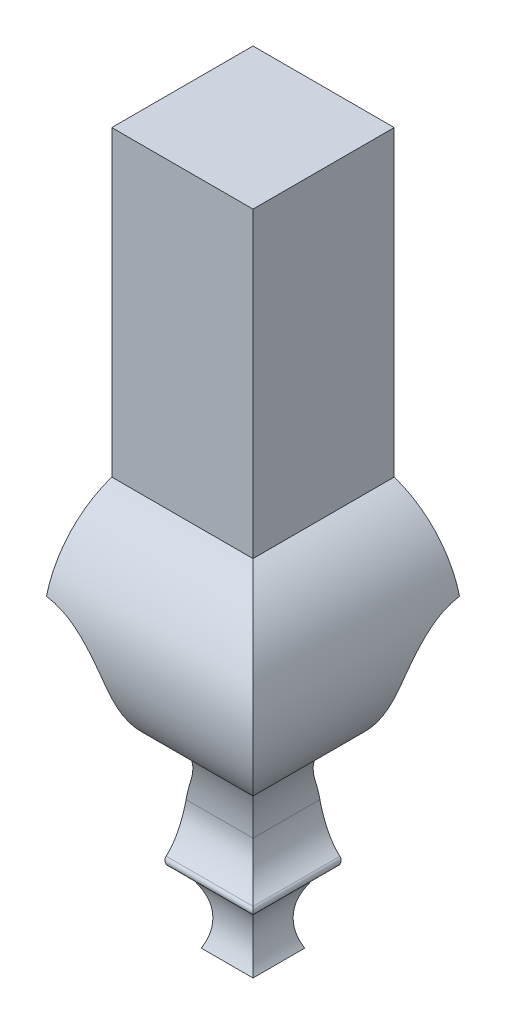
ISO-10303-21;
HEADER;
FILE_DESCRIPTION(('STEP AP214'),'2;1');
FILE_NAME('part.step','',(''),(''),'','','');
FILE_SCHEMA(('AUTOMOTIVE_DESIGN { 1 0 10303 214 1 1 1 1 }'));
ENDSEC;
DATA;
#1=APPLICATION_CONTEXT('core data for automotive mechanical design processes');
#2=APPLICATION_PROTOCOL_DEFINITION('international standard','automotive_design',2000,#1);
#3=PRODUCT_CONTEXT('',#1,'mechanical');
#4=PRODUCT('Part','Part','',(#3));
#5=PRODUCT_RELATED_PRODUCT_CATEGORY('part','',(#4));
#6=PRODUCT_DEFINITION_FORMATION('','',#4);
#7=PRODUCT_DEFINITION_CONTEXT('part definition',#1,'design');
#8=PRODUCT_DEFINITION('design','',#6,#7);
#9=PRODUCT_DEFINITION_SHAPE('','',#8);
#10=(LENGTH_UNIT() NAMED_UNIT(*) SI_UNIT(.MILLI.,.METRE.));
#11=(NAMED_UNIT(*) PLANE_ANGLE_UNIT() SI_UNIT($,.RADIAN.));
#12=(NAMED_UNIT(*) SI_UNIT($,.STERADIAN.) SOLID_ANGLE_UNIT());
#13=UNCERTAINTY_MEASURE_WITH_UNIT(LENGTH_MEASURE(1.E-05),#10,'distance_accuracy_value','');
#14=(GEOMETRIC_REPRESENTATION_CONTEXT(3) GLOBAL_UNCERTAINTY_ASSIGNED_CONTEXT((#13)) GLOBAL_UNIT_ASSIGNED_CONTEXT((#10,
#11,#12)) REPRESENTATION_CONTEXT('',''));
#15=CARTESIAN_POINT('',(0.,0.,0.));
#16=DIRECTION('',(0.,0.,1.));
#17=DIRECTION('',(1.,0.,0.));
#18=AXIS2_PLACEMENT_3D('',#15,#16,#17);
#19=CARTESIAN_POINT('',(-50.,70.,-49.9999999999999));
#20=DIRECTION('',(0.,0.,1.));
#21=DIRECTION('',(1.,0.,0.));
#22=AXIS2_PLACEMENT_3D('',#19,#20,#21);
#23=PLANE('',#22);
#24=DIRECTION('',(0.,-1.,0.));
#25=VECTOR('',#24,1.);
#26=CARTESIAN_POINT('',(20.0000000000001,70.,-50.));
#27=LINE('',#26,#25);
#28=CARTESIAN_POINT('',(20.,170.,-50.));
#29=VERTEX_POINT('',#28);
#30=CARTESIAN_POINT('',(20.0000000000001,20.,-50.));
#31=VERTEX_POINT('',#30);
#32=EDGE_CURVE('E781',#29,#31,#27,.T.);
#33=ORIENTED_EDGE('',*,*,#32,.T.);
#34=CARTESIAN_POINT('',(3.91654214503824,-27.3426064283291,-49.9999999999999));
#35=DIRECTION('',(0.,0.,1.));
#36=DIRECTION('',(1.,0.,0.));
#37=AXIS2_PLACEMENT_3D('',#34,#35,#36);
#38=CIRCLE('',#37,50.);
#39=CARTESIAN_POINT('',(52.3692001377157,-15.,-50.));
#40=VERTEX_POINT('',#39);
#41=EDGE_CURVE('E792',#31,#40,#38,.F.);
#42=ORIENTED_EDGE('',*,*,#41,.T.);
#43=DIRECTION('',(1.,0.,0.));
#44=VECTOR('',#43,1.);
#45=CARTESIAN_POINT('',(-50.,-15.,-49.9999999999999));
#46=LINE('',#45,#44);
#47=CARTESIAN_POINT('',(-49.9999999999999,-15.,-50.));
#48=VERTEX_POINT('',#47);
#49=EDGE_CURVE('E284',#48,#40,#46,.T.);
#50=ORIENTED_EDGE('',*,*,#49,.F.);
#51=DIRECTION('',(0.,-1.,0.));
#52=VECTOR('',#51,1.);
#53=CARTESIAN_POINT('',(-50.,70.,-49.9999999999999));
#54=LINE('',#53,#52);
#55=CARTESIAN_POINT('',(-50.,170.,-50.));
#56=VERTEX_POINT('',#55);
#57=EDGE_CURVE('E274',#56,#48,#54,.T.);
#58=ORIENTED_EDGE('',*,*,#57,.F.);
#59=DIRECTION('',(1.,0.,0.));
#60=VECTOR('',#59,1.);
#61=CARTESIAN_POINT('',(-50.,170.,-50.));
#62=LINE('',#61,#60);
#63=EDGE_CURVE('E283',#56,#29,#62,.T.);
#64=ORIENTED_EDGE('',*,*,#63,.T.);
#65=EDGE_LOOP('',(#33,#42,#50,#58,#64));
#66=FACE_BOUND('',#65,.T.);
#67=CARTESIAN_POINT('',(-4.99999999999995,132.5,-50.));
#68=DIRECTION('',(0.,0.,1.));
#69=DIRECTION('',(0.,-1.,0.));
#70=AXIS2_PLACEMENT_3D('',#67,#68,#69);
#71=CIRCLE('',#70,8.00000000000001);
#72=CARTESIAN_POINT('',(3.00000000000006,132.5,-50.));
#73=VERTEX_POINT('',#72);
#74=CARTESIAN_POINT('',(-13.,132.5,-50.));
#75=VERTEX_POINT('',#74);
#76=EDGE_CURVE('E52',#73,#75,#71,.T.);
#77=ORIENTED_EDGE('',*,*,#76,.T.);
#78=DIRECTION('',(0.,-1.,0.));
#79=VECTOR('',#78,1.);
#80=CARTESIAN_POINT('',(-13.,132.5,-50.));
#81=LINE('',#80,#79);
#82=CARTESIAN_POINT('',(-13.,57.5,-49.9999999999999));
#83=VERTEX_POINT('',#82);
#84=EDGE_CURVE('E226',#75,#83,#81,.T.);
#85=ORIENTED_EDGE('',*,*,#84,.T.);
#86=CARTESIAN_POINT('',(-4.99999999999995,57.5,-50.));
#87=DIRECTION('',(0.,0.,1.));
#88=DIRECTION('',(0.,-1.,0.));
#89=AXIS2_PLACEMENT_3D('',#86,#87,#88);
#90=CIRCLE('',#89,8.00000000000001);
#91=CARTESIAN_POINT('',(3.00000000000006,57.5,-50.));
#92=VERTEX_POINT('',#91);
#93=EDGE_CURVE('E229',#83,#92,#90,.T.);
#94=ORIENTED_EDGE('',*,*,#93,.T.);
#95=DIRECTION('',(0.,1.,0.));
#96=VECTOR('',#95,1.);
#97=CARTESIAN_POINT('',(3.00000000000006,132.5,-50.));
#98=LINE('',#97,#96);
#99=EDGE_CURVE('E235',#92,#73,#98,.T.);
#100=ORIENTED_EDGE('',*,*,#99,.T.);
#101=EDGE_LOOP('',(#77,#85,#94,#100));
#102=FACE_BOUND('',#101,.T.);
#103=ADVANCED_FACE('F35',(#66,#102),#23,.F.);
#104=CARTESIAN_POINT('',(20.,170.,-60.));
#105=DIRECTION('',(0.,1.,0.));
#106=DIRECTION('',(0.,0.,1.));
#107=AXIS2_PLACEMENT_3D('',#104,#105,#106);
#108=PLANE('',#107);
#109=ORIENTED_EDGE('',*,*,#63,.F.);
#110=DIRECTION('',(0.,0.,1.));
#111=VECTOR('',#110,1.);
#112=CARTESIAN_POINT('',(-50.,170.,-60.));
#113=LINE('',#112,#111);
#114=CARTESIAN_POINT('',(-50.,170.,20.0000000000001));
#115=VERTEX_POINT('',#114);
#116=EDGE_CURVE('E432',#56,#115,#113,.T.);
#117=ORIENTED_EDGE('',*,*,#116,.T.);
#118=DIRECTION('',(1.,0.,0.));
#119=VECTOR('',#118,1.);
#120=CARTESIAN_POINT('',(-50.,170.,20.0000000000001));
#121=LINE('',#120,#119);
#122=CARTESIAN_POINT('',(20.,170.,20.));
#123=VERTEX_POINT('',#122);
#124=EDGE_CURVE('E311',#115,#123,#121,.T.);
#125=ORIENTED_EDGE('',*,*,#124,.T.);
#126=DIRECTION('',(0.,0.,1.));
#127=VECTOR('',#126,1.);
#128=CARTESIAN_POINT('',(20.,170.,-60.));
#129=LINE('',#128,#127);
#130=EDGE_CURVE('E813',#29,#123,#129,.T.);
#131=ORIENTED_EDGE('',*,*,#130,.F.);
#132=EDGE_LOOP('',(#109,#117,#125,#131));
#133=FACE_BOUND('',#132,.T.);
#134=ADVANCED_FACE('F347',(#133),#108,.T.);
#135=CARTESIAN_POINT('',(20.0000000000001,70.,-60.));
#136=DIRECTION('',(1.,0.,0.));
#137=DIRECTION('',(0.,1.,0.));
#138=AXIS2_PLACEMENT_3D('',#135,#136,#137);
#139=PLANE('',#138);
#140=ORIENTED_EDGE('',*,*,#32,.F.);
#141=ORIENTED_EDGE('',*,*,#130,.T.);
#142=DIRECTION('',(0.,1.,0.));
#143=VECTOR('',#142,1.);
#144=CARTESIAN_POINT('',(20.0000000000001,70.,20.));
#145=LINE('',#144,#143);
#146=CARTESIAN_POINT('',(20.0000000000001,20.,20.));
#147=VERTEX_POINT('',#146);
#148=EDGE_CURVE('E287',#147,#123,#145,.T.);
#149=ORIENTED_EDGE('',*,*,#148,.F.);
#150=DIRECTION('',(0.,0.,1.));
#151=VECTOR('',#150,1.);
#152=CARTESIAN_POINT('',(20.0000000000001,20.,-60.));
#153=LINE('',#152,#151);
#154=EDGE_CURVE('E810',#31,#147,#153,.T.);
#155=ORIENTED_EDGE('',*,*,#154,.F.);
#156=EDGE_LOOP('',(#140,#141,#149,#155));
#157=FACE_BOUND('',#156,.T.);
#158=ADVANCED_FACE('F350',(#157),#139,.T.);
#159=CARTESIAN_POINT('',(3.91654214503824,-27.3426064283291,-60.));
#160=DIRECTION('',(0.,0.,1.));
#161=DIRECTION('',(1.,0.,0.));
#162=AXIS2_PLACEMENT_3D('',#159,#160,#161);
#163=CYLINDRICAL_SURFACE('',#162,50.);
#164=ORIENTED_EDGE('',*,*,#41,.F.);
#165=ORIENTED_EDGE('',*,*,#154,.T.);
#166=CARTESIAN_POINT('',(3.91654214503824,-27.3426064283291,3.91654214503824));
#167=DIRECTION('',(-0.707106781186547,0.,0.707106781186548));
#168=DIRECTION('',(0.707106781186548,0.,0.707106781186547));
#169=AXIS2_PLACEMENT_3D('',#166,#167,#168);
#170=ELLIPSE('',#169,70.7106781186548,50.);
#171=CARTESIAN_POINT('',(30.0000000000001,-70.,30.));
#172=VERTEX_POINT('',#171);
#173=EDGE_CURVE('E791',#172,#147,#170,.T.);
#174=ORIENTED_EDGE('',*,*,#173,.F.);
#175=DIRECTION('',(0.,0.,1.));
#176=VECTOR('',#175,1.);
#177=CARTESIAN_POINT('',(30.0000000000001,-70.,-60.));
#178=LINE('',#177,#176);
#179=CARTESIAN_POINT('',(30.0000000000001,-70.,-16.3893493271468));
#180=VERTEX_POINT('',#179);
#181=EDGE_CURVE('E808',#180,#172,#178,.T.);
#182=ORIENTED_EDGE('',*,*,#181,.F.);
#183=CARTESIAN_POINT('',(52.2879219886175,-40.,-20.));
#184=CARTESIAN_POINT('',(52.1296895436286,-40.6047607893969,-19.8233069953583));
#185=CARTESIAN_POINT('',(51.9595799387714,-41.2084810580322,-19.6536696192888));
#186=CARTESIAN_POINT('',(51.5956004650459,-42.4125282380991,-19.3283997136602));
#187=CARTESIAN_POINT('',(51.401730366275,-43.012855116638,-19.1727673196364));
#188=CARTESIAN_POINT('',(50.9902512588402,-44.2087210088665,-18.8754218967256));
#189=CARTESIAN_POINT('',(50.7726450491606,-44.8042605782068,-18.7337072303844));
#190=CARTESIAN_POINT('',(50.313790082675,-45.9892969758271,-18.4639702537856));
#191=CARTESIAN_POINT('',(50.07254148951,-46.5787938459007,-18.3359478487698));
#192=CARTESIAN_POINT('',(49.5673068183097,-47.7487963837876,-18.0936533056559));
#193=CARTESIAN_POINT('',(49.303386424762,-48.3293226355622,-17.9793436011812));
#194=CARTESIAN_POINT('',(48.7524883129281,-49.4818462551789,-17.7636913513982));
#195=CARTESIAN_POINT('',(48.4655083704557,-50.0538427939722,-17.6623500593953));
#196=CARTESIAN_POINT('',(47.8689091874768,-51.1879379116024,-17.4722309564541));
#197=CARTESIAN_POINT('',(47.5592931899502,-51.7500378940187,-17.3834513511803));
#198=CARTESIAN_POINT('',(46.9178256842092,-52.8632359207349,-17.2179355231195));
#199=CARTESIAN_POINT('',(46.5859720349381,-53.4143328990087,-17.1412004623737));
#200=CARTESIAN_POINT('',(45.5576134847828,-55.0496205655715,-16.9282169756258));
#201=CARTESIAN_POINT('',(44.8283479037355,-56.1157377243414,-16.8092018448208));
#202=CARTESIAN_POINT('',(43.2874764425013,-58.1906261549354,-16.6121313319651));
#203=CARTESIAN_POINT('',(42.4758613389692,-59.1993909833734,-16.5340805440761));
#204=CARTESIAN_POINT('',(40.7760170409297,-61.1516843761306,-16.4132060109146));
#205=CARTESIAN_POINT('',(39.8878170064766,-62.0952375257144,-16.3703689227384));
#206=CARTESIAN_POINT('',(38.0405717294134,-63.9107177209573,-16.3137745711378));
#207=CARTESIAN_POINT('',(37.0815494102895,-64.7826677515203,-16.3000079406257));
#208=CARTESIAN_POINT('',(35.6106227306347,-66.0191943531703,-16.296489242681));
#209=CARTESIAN_POINT('',(35.1233441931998,-66.4134185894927,-16.2980112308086));
#210=CARTESIAN_POINT('',(34.1344166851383,-67.1831946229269,-16.3056856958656));
#211=CARTESIAN_POINT('',(33.6327709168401,-67.5587505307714,-16.3118371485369));
#212=CARTESIAN_POINT('',(32.6167811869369,-68.2899780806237,-16.3280549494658));
#213=CARTESIAN_POINT('',(32.1024644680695,-68.6456877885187,-16.3381134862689));
#214=CARTESIAN_POINT('',(31.0608001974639,-69.3376111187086,-16.3614705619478));
#215=CARTESIAN_POINT('',(30.5334500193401,-69.6738207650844,-16.3747697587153));
#216=CARTESIAN_POINT('',(30.0000000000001,-70.,-16.3893493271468));
#217=B_SPLINE_CURVE_WITH_KNOTS('',3,(#183,#184,#185,#186,#187,#188,#189,#190,#191,#192,#193,
#194,#195,#196,#197,#198,#199,#200,#201,#202,#203,#204,#205,#206,#207,#208,#209,#210,#211,#212,
#213,#214,#215,#216),.UNSPECIFIED.,.F.,.F.,(4,2,2,2,2,2,2,2,2,2,2,2,2,2,2,2,4),(0.,
1.94869163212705,3.89740212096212,5.84588306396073,7.7943505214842,9.73735190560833,
11.6805409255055,13.6234520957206,15.5665506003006,19.4529874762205,23.3398601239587,
27.2252593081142,31.1094063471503,32.9893818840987,34.868941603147,36.7447626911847,
38.620964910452),.UNSPECIFIED.);
#218=CARTESIAN_POINT('',(52.2879219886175,-40.,-20.));
#219=VERTEX_POINT('',#218);
#220=EDGE_CURVE('E373',#219,#180,#217,.T.);
#221=ORIENTED_EDGE('',*,*,#220,.F.);
#222=CARTESIAN_POINT('',(52.3692001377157,-15.,-50.));
#223=CARTESIAN_POINT('',(52.3820390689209,-15.0504549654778,-49.5114079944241));
#224=CARTESIAN_POINT('',(52.3974427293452,-15.1112009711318,-49.0239551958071));
#225=CARTESIAN_POINT('',(52.4330324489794,-15.2531122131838,-48.0522203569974));
#226=CARTESIAN_POINT('',(52.4532183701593,-15.334276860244,-47.5679382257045));
#227=CARTESIAN_POINT('',(52.4980205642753,-15.5168419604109,-46.603532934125));
#228=CARTESIAN_POINT('',(52.5226356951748,-15.6182371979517,-46.1234087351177));
#229=CARTESIAN_POINT('',(52.5758405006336,-15.841051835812,-45.1680848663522));
#230=CARTESIAN_POINT('',(52.6044301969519,-15.9624713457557,-44.6928852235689));
#231=CARTESIAN_POINT('',(52.6953663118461,-16.3562794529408,-43.2764588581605));
#232=CARTESIAN_POINT('',(52.7629171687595,-16.6583643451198,-42.3436307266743));
#233=CARTESIAN_POINT('',(52.9069123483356,-17.3393816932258,-40.5072889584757));
#234=CARTESIAN_POINT('',(52.9833571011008,-17.7183178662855,-39.6037767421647));
#235=CARTESIAN_POINT('',(53.1392418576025,-18.5502908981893,-37.8322095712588));
#236=CARTESIAN_POINT('',(53.2186806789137,-19.0032987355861,-36.9641408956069));
#237=CARTESIAN_POINT('',(53.3740517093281,-19.980579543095,-35.2687564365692));
#238=CARTESIAN_POINT('',(53.4499839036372,-20.5048528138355,-34.4414408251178));
#239=CARTESIAN_POINT('',(53.5913380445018,-21.6214755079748,-32.8328596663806));
#240=CARTESIAN_POINT('',(53.6567578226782,-22.2138389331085,-32.0516036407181));
#241=CARTESIAN_POINT('',(53.7697227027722,-23.462743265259,-30.5407653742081));
#242=CARTESIAN_POINT('',(53.8172683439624,-24.1192822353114,-29.8111815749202));
#243=CARTESIAN_POINT('',(53.8870461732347,-25.4927291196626,-28.4083579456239));
#244=CARTESIAN_POINT('',(53.9092513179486,-26.2097006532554,-27.7351790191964));
#245=CARTESIAN_POINT('',(53.9208118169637,-27.6981951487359,-26.4512340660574));
#246=CARTESIAN_POINT('',(53.9101639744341,-28.4697234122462,-25.8404741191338));
#247=CARTESIAN_POINT('',(53.864307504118,-29.6618394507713,-24.9757771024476));
#248=CARTESIAN_POINT('',(53.8440652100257,-30.0647286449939,-24.6962917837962));
#249=CARTESIAN_POINT('',(53.7928315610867,-30.8813958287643,-24.1547925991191));
#250=CARTESIAN_POINT('',(53.761841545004,-31.2951724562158,-23.8927765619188));
#251=CARTESIAN_POINT('',(53.6883606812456,-32.1324550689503,-23.3868453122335));
#252=CARTESIAN_POINT('',(53.6458737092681,-32.5559577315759,-23.1429240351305));
#253=CARTESIAN_POINT('',(53.5487076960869,-33.4116702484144,-22.6735962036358));
#254=CARTESIAN_POINT('',(53.4940301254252,-33.8438790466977,-22.4481874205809));
#255=CARTESIAN_POINT('',(53.3679849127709,-34.7435513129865,-22.0025628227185));
#256=CARTESIAN_POINT('',(53.2957782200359,-35.2115112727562,-21.783584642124));
#257=CARTESIAN_POINT('',(53.1362580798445,-36.1544288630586,-21.3674354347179));
#258=CARTESIAN_POINT('',(53.0489465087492,-36.6293856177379,-21.1702617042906));
#259=CARTESIAN_POINT('',(52.8587063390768,-37.5847545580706,-20.7979876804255));
#260=CARTESIAN_POINT('',(52.7557787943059,-38.0651663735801,-20.622885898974));
#261=CARTESIAN_POINT('',(52.5339295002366,-39.0300094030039,-20.2948018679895));
#262=CARTESIAN_POINT('',(52.4150027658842,-39.514441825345,-20.1418265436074));
#263=CARTESIAN_POINT('',(52.2879219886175,-40.,-20.));
#264=B_SPLINE_CURVE_WITH_KNOTS('',3,(#222,#223,#224,#225,#226,#227,#228,#229,#230,#231,#232,
#233,#234,#235,#236,#237,#238,#239,#240,#241,#242,#243,#244,#245,#246,#247,#248,#249,#250,#251,
#252,#253,#254,#255,#256,#257,#258,#259,#260,#261,#262,#263),.UNSPECIFIED.,.F.,.F.,(4,2,2,2,2,2,
2,2,2,2,2,2,2,2,2,2,2,2,2,2,4),(0.,1.47394325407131,2.94784397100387,4.42136519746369,
5.89489449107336,8.839594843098,11.7844376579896,14.7281294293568,17.6718336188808,
20.6161442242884,23.5603659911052,26.5077269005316,29.4553746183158,30.9271912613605,
32.3988246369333,33.8699625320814,35.3409230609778,36.9052450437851,38.4693728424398,
40.0333951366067,41.5979058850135),.UNSPECIFIED.);
#265=EDGE_CURVE('E365',#40,#219,#264,.T.);
#266=ORIENTED_EDGE('',*,*,#265,.F.);
#267=EDGE_LOOP('',(#164,#165,#174,#182,#221,#266));
#268=FACE_BOUND('',#267,.T.);
#269=ADVANCED_FACE('F354',(#268),#163,.T.);
#270=CARTESIAN_POINT('',(57.2668114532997,-114.592673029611,-60.));
#271=DIRECTION('',(0.,0.,1.));
#272=DIRECTION('',(1.,0.,0.));
#273=AXIS2_PLACEMENT_3D('',#270,#271,#272);
#274=CYLINDRICAL_SURFACE('',#273,52.2683986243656);
#275=CARTESIAN_POINT('',(30.0000000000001,-70.,-16.3893493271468));
#276=CARTESIAN_POINT('',(29.4084366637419,-70.3617086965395,-16.4055244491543));
#277=CARTESIAN_POINT('',(28.8241322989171,-70.7351730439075,-16.4243497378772));
#278=CARTESIAN_POINT('',(27.6709810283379,-71.5049409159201,-16.4681405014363));
#279=CARTESIAN_POINT('',(27.1021345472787,-71.9012450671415,-16.4931061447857));
#280=CARTESIAN_POINT('',(25.9807375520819,-72.7160975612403,-16.5500234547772));
#281=CARTESIAN_POINT('',(25.4281909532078,-73.134651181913,-16.581976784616));
#282=CARTESIAN_POINT('',(24.3405211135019,-73.9931034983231,-16.653718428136));
#283=CARTESIAN_POINT('',(23.8053977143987,-74.4330020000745,-16.6935066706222));
#284=CARTESIAN_POINT('',(22.2279480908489,-75.783164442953,-16.8258854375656));
#285=CARTESIAN_POINT('',(21.2128793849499,-76.7243774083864,-16.9315215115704));
#286=CARTESIAN_POINT('',(19.2631796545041,-78.681437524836,-17.1843774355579));
#287=CARTESIAN_POINT('',(18.3285393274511,-79.6972760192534,-17.3315924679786));
#288=CARTESIAN_POINT('',(16.990513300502,-81.2717743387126,-17.5886056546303));
#289=CARTESIAN_POINT('',(16.5545150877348,-81.8059582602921,-17.6804844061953));
#290=CARTESIAN_POINT('',(15.7050735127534,-82.8896579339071,-17.8770445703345));
#291=CARTESIAN_POINT('',(15.2916280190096,-83.4391722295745,-17.9817247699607));
#292=CARTESIAN_POINT('',(14.4878855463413,-84.5523593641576,-18.2046054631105));
#293=CARTESIAN_POINT('',(14.097592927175,-85.1160348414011,-18.32280849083));
#294=CARTESIAN_POINT('',(13.3408669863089,-86.2560379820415,-18.573337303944));
#295=CARTESIAN_POINT('',(12.9744312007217,-86.832364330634,-18.7056616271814));
#296=CARTESIAN_POINT('',(12.2662847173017,-87.9956570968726,-18.9848447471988));
#297=CARTESIAN_POINT('',(11.9245469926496,-88.582610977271,-19.1316872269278));
#298=CARTESIAN_POINT('',(11.2657986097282,-89.7662553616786,-19.4404880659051));
#299=CARTESIAN_POINT('',(10.9487855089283,-90.3629448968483,-19.6024449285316));
#300=CARTESIAN_POINT('',(10.3398129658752,-91.564519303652,-19.9418491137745));
#301=CARTESIAN_POINT('',(10.0478494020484,-92.1694028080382,-20.1192938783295));
#302=CARTESIAN_POINT('',(9.48914781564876,-93.3858723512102,-20.4899722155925));
#303=CARTESIAN_POINT('',(9.22240829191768,-93.9974579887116,-20.6832048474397));
#304=CARTESIAN_POINT('',(8.61411163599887,-95.4678598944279,-21.1649797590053));
#305=CARTESIAN_POINT('',(8.28447056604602,-96.3291681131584,-21.4610830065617));
#306=CARTESIAN_POINT('',(7.67430869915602,-98.0575834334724,-22.0845885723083));
#307=CARTESIAN_POINT('',(7.39378005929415,-98.9246895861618,-22.4119858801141));
#308=CARTESIAN_POINT('',(6.88109122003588,-100.661252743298,-23.0981995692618));
#309=CARTESIAN_POINT('',(6.64895025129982,-101.530710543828,-23.4570283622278));
#310=CARTESIAN_POINT('',(6.33642359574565,-102.833392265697,-24.0183833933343));
#311=CARTESIAN_POINT('',(6.23818796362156,-103.267409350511,-24.2093727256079));
#312=CARTESIAN_POINT('',(6.05344687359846,-104.134505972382,-24.598979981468));
#313=CARTESIAN_POINT('',(5.96694120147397,-104.567585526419,-24.7975977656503));
#314=CARTESIAN_POINT('',(5.88621084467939,-105.,-24.9999999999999));
#315=B_SPLINE_CURVE_WITH_KNOTS('',3,(#275,#276,#277,#278,#279,#280,#281,#282,#283,#284,#285,
#286,#287,#288,#289,#290,#291,#292,#293,#294,#295,#296,#297,#298,#299,#300,#301,#302,#303,#304,
#305,#306,#307,#308,#309,#310,#311,#312,#313,#314),.UNSPECIFIED.,.F.,.F.,(4,2,2,2,2,2,2,2,2,2,2,
2,2,2,2,2,2,2,2,4),(0.,2.08057271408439,4.16120253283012,6.24232811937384,8.32343479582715,
12.483194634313,16.6424726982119,18.7287900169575,20.8149098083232,22.9014211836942,
24.9877167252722,27.0716935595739,29.1554642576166,31.2388914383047,33.3221945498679,
36.2261131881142,39.1295676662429,42.0341738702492,43.4867497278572,44.9392990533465),.UNSPECIFIED.);
#316=CARTESIAN_POINT('',(5.88621084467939,-105.,-24.9999999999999));
#317=VERTEX_POINT('',#316);
#318=EDGE_CURVE('E381',#180,#317,#315,.T.);
#319=ORIENTED_EDGE('',*,*,#318,.F.);
#320=ORIENTED_EDGE('',*,*,#181,.T.);
#321=CARTESIAN_POINT('',(57.2668114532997,-114.592673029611,57.2668114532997));
#322=DIRECTION('',(-0.707106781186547,0.,0.707106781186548));
#323=DIRECTION('',(0.707106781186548,0.,0.707106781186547));
#324=AXIS2_PLACEMENT_3D('',#321,#322,#323);
#325=ELLIPSE('',#324,73.918678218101,52.2683986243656);
#326=CARTESIAN_POINT('',(5.00000000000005,-115.,5.00000000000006));
#327=VERTEX_POINT('',#326);
#328=EDGE_CURVE('E780',#327,#172,#325,.F.);
#329=ORIENTED_EDGE('',*,*,#328,.F.);
#330=DIRECTION('',(0.,0.,1.));
#331=VECTOR('',#330,1.);
#332=CARTESIAN_POINT('',(5.00000000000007,-115.,-60.));
#333=LINE('',#332,#331);
#334=CARTESIAN_POINT('',(5.00000000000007,-115.,-28.1625076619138));
#335=VERTEX_POINT('',#334);
#336=EDGE_CURVE('E753',#335,#327,#333,.T.);
#337=ORIENTED_EDGE('',*,*,#336,.F.);
#338=CARTESIAN_POINT('',(5.8862108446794,-105.,-24.9999999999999));
#339=CARTESIAN_POINT('',(5.81256021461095,-105.394477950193,-25.1846444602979));
#340=CARTESIAN_POINT('',(5.74294289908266,-105.792562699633,-25.3631188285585));
#341=CARTESIAN_POINT('',(5.612216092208,-106.595564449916,-25.7074264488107));
#342=CARTESIAN_POINT('',(5.55110710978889,-107.000481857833,-25.8732589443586));
#343=CARTESIAN_POINT('',(5.38194128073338,-108.219620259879,-26.3492722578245));
#344=CARTESIAN_POINT('',(5.28709294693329,-109.043283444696,-26.6403372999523));
#345=CARTESIAN_POINT('',(5.13600095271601,-110.711276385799,-27.1687354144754));
#346=CARTESIAN_POINT('',(5.07976055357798,-111.555607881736,-27.4060639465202));
#347=CARTESIAN_POINT('',(5.02617164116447,-112.836159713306,-27.7208954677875));
#348=CARTESIAN_POINT('',(5.01344636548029,-113.266742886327,-27.8192251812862));
#349=CARTESIAN_POINT('',(4.99866251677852,-114.13112307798,-28.0016115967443));
#350=CARTESIAN_POINT('',(4.99660443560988,-114.564920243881,-28.0856676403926));
#351=CARTESIAN_POINT('',(5.00000000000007,-115.,-28.1625076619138));
#352=B_SPLINE_CURVE_WITH_KNOTS('',3,(#338,#339,#340,#341,#342,#343,#344,#345,#346,#347,#348,
#349,#350,#351),.UNSPECIFIED.,.F.,.F.,(4,2,2,2,2,2,4),(0.,1.32506477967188,2.65020878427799,
5.28355004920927,7.91711372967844,9.24234053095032,10.5676284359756),.UNSPECIFIED.);
#353=EDGE_CURVE('E421',#317,#335,#352,.T.);
#354=ORIENTED_EDGE('',*,*,#353,.F.);
#355=EDGE_LOOP('',(#319,#320,#329,#337,#354));
#356=FACE_BOUND('',#355,.T.);
#357=ADVANCED_FACE('F359',(#356),#274,.F.);
#358=CARTESIAN_POINT('',(26.052084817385,-114.835936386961,-60.));
#359=DIRECTION('',(0.,0.,1.));
#360=DIRECTION('',(1.,0.,0.));
#361=AXIS2_PLACEMENT_3D('',#358,#359,#360);
#362=CYLINDRICAL_SURFACE('',#361,21.0527240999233);
#363=CARTESIAN_POINT('',(26.052084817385,-114.835936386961,26.052084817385));
#364=DIRECTION('',(-0.707106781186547,0.,0.707106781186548));
#365=DIRECTION('',(0.707106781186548,0.,0.707106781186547));
#366=AXIS2_PLACEMENT_3D('',#363,#364,#365);
#367=ELLIPSE('',#366,29.7730479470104,21.0527240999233);
#368=CARTESIAN_POINT('',(15.9403865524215,-133.301329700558,15.9403865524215));
#369=VERTEX_POINT('',#368);
#370=EDGE_CURVE('E380',#369,#327,#367,.F.);
#371=ORIENTED_EDGE('',*,*,#370,.F.);
#372=DIRECTION('',(0.,0.,1.));
#373=VECTOR('',#372,1.);
#374=CARTESIAN_POINT('',(15.9403865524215,-133.301329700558,-60.));
#375=LINE('',#374,#373);
#376=CARTESIAN_POINT('',(15.9403865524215,-133.301329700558,-27.1298312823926));
#377=VERTEX_POINT('',#376);
#378=EDGE_CURVE('E484',#369,#377,#375,.F.);
#379=ORIENTED_EDGE('',*,*,#378,.T.);
#380=CARTESIAN_POINT('',(5.00000000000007,-115.,-28.1625076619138));
#381=CARTESIAN_POINT('',(5.00206207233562,-115.264824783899,-28.2092844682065));
#382=CARTESIAN_POINT('',(5.00912911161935,-115.530057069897,-28.2533719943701));
#383=CARTESIAN_POINT('',(5.03334932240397,-116.060904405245,-28.3361315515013));
#384=CARTESIAN_POINT('',(5.05050246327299,-116.32651945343,-28.3748035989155));
#385=CARTESIAN_POINT('',(5.11719121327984,-117.123123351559,-28.4826185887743));
#386=CARTESIAN_POINT('',(5.1819573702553,-117.654040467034,-28.5435902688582));
#387=CARTESIAN_POINT('',(5.35192993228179,-118.709648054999,-28.6436453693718));
#388=CARTESIAN_POINT('',(5.45700341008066,-119.234353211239,-28.6827997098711));
#389=CARTESIAN_POINT('',(5.64455868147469,-120.014908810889,-28.7258478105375));
#390=CARTESIAN_POINT('',(5.71207127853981,-120.274020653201,-28.7375834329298));
#391=CARTESIAN_POINT('',(5.85699789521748,-120.7897088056,-28.7559704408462));
#392=CARTESIAN_POINT('',(5.93441424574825,-121.046284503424,-28.7626206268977));
#393=CARTESIAN_POINT('',(6.18133022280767,-121.811424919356,-28.7751628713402));
#394=CARTESIAN_POINT('',(6.36551143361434,-122.315463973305,-28.7736499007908));
#395=CARTESIAN_POINT('',(6.77167517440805,-123.307678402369,-28.7524529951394));
#396=CARTESIAN_POINT('',(6.99365964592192,-123.795852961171,-28.7327681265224));
#397=CARTESIAN_POINT('',(7.35374522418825,-124.513802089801,-28.6911098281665));
#398=CARTESIAN_POINT('',(7.47833579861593,-124.750806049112,-28.6751949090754));
#399=CARTESIAN_POINT('',(7.73629957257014,-125.219614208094,-28.639602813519));
#400=CARTESIAN_POINT('',(7.86967045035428,-125.451419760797,-28.619926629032));
#401=CARTESIAN_POINT('',(8.28268846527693,-126.138650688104,-28.5556751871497));
#402=CARTESIAN_POINT('',(8.57525452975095,-126.585917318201,-28.5058754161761));
#403=CARTESIAN_POINT('',(9.20122781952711,-127.467892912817,-28.3933193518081));
#404=CARTESIAN_POINT('',(9.53553654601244,-127.901918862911,-28.3302445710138));
#405=CARTESIAN_POINT('',(10.2361553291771,-128.741784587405,-28.1948827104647));
#406=CARTESIAN_POINT('',(10.6024656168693,-129.147624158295,-28.1225955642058));
#407=CARTESIAN_POINT('',(11.3650818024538,-129.929227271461,-27.9717252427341));
#408=CARTESIAN_POINT('',(11.7614040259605,-130.304974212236,-27.8931386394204));
#409=CARTESIAN_POINT('',(12.5816631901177,-131.024282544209,-27.7327081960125));
#410=CARTESIAN_POINT('',(13.0056023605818,-131.367841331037,-27.6508640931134));
#411=CARTESIAN_POINT('',(13.9335095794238,-132.061893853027,-27.4766698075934));
#412=CARTESIAN_POINT('',(14.4408546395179,-132.407878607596,-27.3842861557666));
#413=CARTESIAN_POINT('',(15.4843135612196,-133.054504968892,-27.203434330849));
#414=CARTESIAN_POINT('',(16.0204285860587,-133.355144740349,-27.1149663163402));
#415=CARTESIAN_POINT('',(17.1183061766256,-133.909028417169,-26.9459456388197));
#416=CARTESIAN_POINT('',(17.6800825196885,-134.162246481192,-26.8653973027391));
#417=CARTESIAN_POINT('',(18.5386895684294,-134.504723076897,-26.7533942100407));
#418=CARTESIAN_POINT('',(18.8276160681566,-134.612677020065,-26.7175226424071));
#419=CARTESIAN_POINT('',(19.4103015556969,-134.815903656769,-26.6491347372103));
#420=CARTESIAN_POINT('',(19.7040607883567,-134.91117570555,-26.6166185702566));
#421=CARTESIAN_POINT('',(20.,-135.,-26.5859855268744));
#422=B_SPLINE_CURVE_WITH_KNOTS('',3,(#380,#381,#382,#383,#384,#385,#386,#387,#388,#389,#390,
#391,#392,#393,#394,#395,#396,#397,#398,#399,#400,#401,#402,#403,#404,#405,#406,#407,#408,#409,
#410,#411,#412,#413,#414,#415,#416,#417,#418,#419,#420,#421),.UNSPECIFIED.,.F.,.F.,(4,2,2,2,2,2,
2,2,2,2,2,2,2,2,2,2,2,2,2,2,4),(0.,0.806678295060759,1.61335414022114,3.22619115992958,
4.83375439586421,5.63760093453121,6.44163701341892,8.04952128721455,9.65748816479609,
10.4619830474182,11.2662660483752,12.8747416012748,14.5274256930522,16.180121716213,
17.8337233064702,19.4874585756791,21.3480728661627,23.2087624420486,25.070463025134,
26.0017340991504,26.9330525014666),.UNSPECIFIED.);
#423=EDGE_CURVE('E416',#335,#377,#422,.T.);
#424=ORIENTED_EDGE('',*,*,#423,.F.);
#425=ORIENTED_EDGE('',*,*,#336,.T.);
#426=EDGE_LOOP('',(#371,#379,#424,#425));
#427=FACE_BOUND('',#426,.T.);
#428=ADVANCED_FACE('F439',(#427),#362,.F.);
#429=CARTESIAN_POINT('',(26.8836735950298,-155.895335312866,-60.));
#430=DIRECTION('',(0.,0.,1.));
#431=DIRECTION('',(1.,0.,0.));
#432=AXIS2_PLACEMENT_3D('',#429,#430,#431);
#433=CYLINDRICAL_SURFACE('',#432,22.);
#434=CARTESIAN_POINT('',(20.,-135.,-26.5859855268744));
#435=CARTESIAN_POINT('',(19.7274927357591,-135.089772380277,-26.5550172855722));
#436=CARTESIAN_POINT('',(19.4569964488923,-135.184795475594,-26.5218878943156));
#437=CARTESIAN_POINT('',(18.9204361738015,-135.385121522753,-26.451096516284));
#438=CARTESIAN_POINT('',(18.6543722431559,-135.490424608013,-26.4134344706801));
#439=CARTESIAN_POINT('',(17.8635426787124,-135.821381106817,-26.2933484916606));
#440=CARTESIAN_POINT('',(17.346048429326,-136.062111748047,-26.2038145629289));
#441=CARTESIAN_POINT('',(16.3362668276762,-136.580232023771,-26.0044510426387));
#442=CARTESIAN_POINT('',(15.8438973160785,-136.85748991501,-25.8946938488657));
#443=CARTESIAN_POINT('',(14.8858469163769,-137.446264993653,-25.6529115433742));
#444=CARTESIAN_POINT('',(14.4201641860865,-137.757779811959,-25.5208879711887));
#445=CARTESIAN_POINT('',(13.5177500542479,-138.412104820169,-25.2326009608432));
#446=CARTESIAN_POINT('',(13.0810791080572,-138.754977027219,-25.0762890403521));
#447=CARTESIAN_POINT('',(12.2404830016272,-139.467296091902,-24.738135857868));
#448=CARTESIAN_POINT('',(11.8365595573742,-139.836744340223,-24.556293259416));
#449=CARTESIAN_POINT('',(11.0635678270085,-140.597671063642,-24.1658755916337));
#450=CARTESIAN_POINT('',(10.6945139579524,-140.989158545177,-23.9572895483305));
#451=CARTESIAN_POINT('',(9.99305081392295,-141.788963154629,-23.5127643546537));
#452=CARTESIAN_POINT('',(9.66063668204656,-142.197278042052,-23.2768288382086));
#453=CARTESIAN_POINT('',(9.0793195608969,-142.964692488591,-22.8141138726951));
#454=CARTESIAN_POINT('',(8.82532201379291,-143.322211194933,-22.5910802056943));
#455=CARTESIAN_POINT('',(8.34455689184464,-144.042544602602,-22.125128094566));
#456=CARTESIAN_POINT('',(8.11778932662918,-144.4053593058,-21.8822096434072));
#457=CARTESIAN_POINT('',(7.69116938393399,-145.133103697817,-21.3769513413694));
#458=CARTESIAN_POINT('',(7.49130917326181,-145.498032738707,-21.114617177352));
#459=CARTESIAN_POINT('',(7.2111256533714,-146.044810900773,-20.7070537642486));
#460=CARTESIAN_POINT('',(7.12100098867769,-146.226963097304,-20.5688592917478));
#461=CARTESIAN_POINT('',(6.94714110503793,-146.590750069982,-20.2878652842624));
#462=CARTESIAN_POINT('',(6.86340559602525,-146.772384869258,-20.1450659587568));
#463=CARTESIAN_POINT('',(6.78278862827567,-146.953611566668,-19.9999999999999));
#464=B_SPLINE_CURVE_WITH_KNOTS('',3,(#434,#435,#436,#437,#438,#439,#440,#441,#442,#443,#444,
#445,#446,#447,#448,#449,#450,#451,#452,#453,#454,#455,#456,#457,#458,#459,#460,#461,#462,#463),
.UNSPECIFIED.,.F.,.F.,(4,2,2,2,2,2,2,2,2,2,2,2,2,2,4),(0.,0.86560860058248,1.73122843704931,
3.46218042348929,5.18705205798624,6.91180448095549,8.64004501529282,10.3683760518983,
12.0974185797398,13.8262316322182,15.3010989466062,16.775966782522,18.2504043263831,
18.9875856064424,19.7247333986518),.UNSPECIFIED.);
#465=CARTESIAN_POINT('',(15.9717706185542,-136.792184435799,-25.9194756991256));
#466=VERTEX_POINT('',#465);
#467=CARTESIAN_POINT('',(6.78278862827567,-146.953611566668,-19.9999999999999));
#468=VERTEX_POINT('',#467);
#469=EDGE_CURVE('E407',#466,#468,#464,.T.);
#470=ORIENTED_EDGE('',*,*,#469,.F.);
#471=DIRECTION('',(0.,0.,1.));
#472=VECTOR('',#471,1.);
#473=CARTESIAN_POINT('',(15.9717706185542,-136.792184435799,-60.));
#474=LINE('',#473,#472);
#475=CARTESIAN_POINT('',(15.9717706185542,-136.792184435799,15.9717706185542));
#476=VERTEX_POINT('',#475);
#477=EDGE_CURVE('E481',#466,#476,#474,.T.);
#478=ORIENTED_EDGE('',*,*,#477,.T.);
#479=CARTESIAN_POINT('',(26.8836735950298,-155.895335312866,26.8836735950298));
#480=DIRECTION('',(-0.707106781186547,0.,0.707106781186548));
#481=DIRECTION('',(0.707106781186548,0.,0.707106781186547));
#482=AXIS2_PLACEMENT_3D('',#479,#480,#481);
#483=ELLIPSE('',#482,31.1126983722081,22.);
#484=CARTESIAN_POINT('',(10.0000000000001,-170.,10.0000000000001));
#485=VERTEX_POINT('',#484);
#486=EDGE_CURVE('E457',#485,#476,#483,.F.);
#487=ORIENTED_EDGE('',*,*,#486,.F.);
#488=DIRECTION('',(0.,0.,1.));
#489=VECTOR('',#488,1.);
#490=CARTESIAN_POINT('',(10.0000000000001,-170.,-60.));
#491=LINE('',#490,#489);
#492=CARTESIAN_POINT('',(10.0000000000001,-170.,-15.6450162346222));
#493=VERTEX_POINT('',#492);
#494=EDGE_CURVE('E747',#493,#485,#491,.T.);
#495=ORIENTED_EDGE('',*,*,#494,.F.);
#496=CARTESIAN_POINT('',(6.78278862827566,-146.953611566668,-19.9999999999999));
#497=CARTESIAN_POINT('',(6.60292410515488,-147.357896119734,-19.6763599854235));
#498=CARTESIAN_POINT('',(6.43207219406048,-147.774868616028,-19.3632337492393));
#499=CARTESIAN_POINT('',(6.11166155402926,-148.633549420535,-18.759926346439));
#500=CARTESIAN_POINT('',(5.96212449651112,-149.075282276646,-18.4697686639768));
#501=CARTESIAN_POINT('',(5.68700615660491,-149.985272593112,-17.9129901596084));
#502=CARTESIAN_POINT('',(5.56160425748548,-150.453697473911,-17.646552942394));
#503=CARTESIAN_POINT('',(5.33970685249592,-151.412107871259,-17.1421419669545));
#504=CARTESIAN_POINT('',(5.24320279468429,-151.902086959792,-16.9041598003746));
#505=CARTESIAN_POINT('',(5.08199072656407,-152.904366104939,-16.4575826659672));
#506=CARTESIAN_POINT('',(5.01749605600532,-153.416791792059,-16.2491913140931));
#507=CARTESIAN_POINT('',(4.92450649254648,-154.457353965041,-15.86599470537));
#508=CARTESIAN_POINT('',(4.89601455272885,-154.985491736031,-15.6911922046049));
#509=CARTESIAN_POINT('',(4.87779789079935,-156.050921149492,-15.3776850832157));
#510=CARTESIAN_POINT('',(4.88792784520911,-156.588170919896,-15.2388472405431));
#511=CARTESIAN_POINT('',(4.94857871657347,-157.668517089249,-14.9976237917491));
#512=CARTESIAN_POINT('',(4.99909362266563,-158.211612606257,-14.8952327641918));
#513=CARTESIAN_POINT('',(5.13345930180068,-159.236665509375,-14.7366689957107));
#514=CARTESIAN_POINT('',(5.21290352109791,-159.718604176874,-14.6765838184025));
#515=CARTESIAN_POINT('',(5.40439862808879,-160.678669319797,-14.5848579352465));
#516=CARTESIAN_POINT('',(5.51644727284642,-161.156796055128,-14.5532152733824));
#517=CARTESIAN_POINT('',(5.77278600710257,-162.106007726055,-14.5172959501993));
#518=CARTESIAN_POINT('',(5.91711759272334,-162.577082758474,-14.5130547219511));
#519=CARTESIAN_POINT('',(6.23690163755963,-163.50802511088,-14.5304155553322));
#520=CARTESIAN_POINT('',(6.41235380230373,-163.967892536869,-14.5520173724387));
#521=CARTESIAN_POINT('',(6.78742714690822,-164.860171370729,-14.6180169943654));
#522=CARTESIAN_POINT('',(6.98619790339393,-165.292992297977,-14.6617341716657));
#523=CARTESIAN_POINT('',(7.41025712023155,-166.142852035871,-14.7693805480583));
#524=CARTESIAN_POINT('',(7.63554774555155,-166.55988955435,-14.8333113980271));
#525=CARTESIAN_POINT('',(8.11072197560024,-167.375705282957,-14.9788846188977));
#526=CARTESIAN_POINT('',(8.36057392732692,-167.774506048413,-15.0605043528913));
#527=CARTESIAN_POINT('',(8.88347008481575,-168.552837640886,-15.2389718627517));
#528=CARTESIAN_POINT('',(9.1565055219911,-168.932375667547,-15.3358138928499));
#529=CARTESIAN_POINT('',(9.53147078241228,-169.420254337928,-15.4720808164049));
#530=CARTESIAN_POINT('',(9.6237054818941,-169.537761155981,-15.5058455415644));
#531=CARTESIAN_POINT('',(9.81026900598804,-169.770531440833,-15.5745572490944));
#532=CARTESIAN_POINT('',(9.90459547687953,-169.885797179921,-15.6095029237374));
#533=CARTESIAN_POINT('',(10.,-170.,-15.6450162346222));
#534=B_SPLINE_CURVE_WITH_KNOTS('',3,(#496,#497,#498,#499,#500,#501,#502,#503,#504,#505,#506,
#507,#508,#509,#510,#511,#512,#513,#514,#515,#516,#517,#518,#519,#520,#521,#522,#523,#524,#525,
#526,#527,#528,#529,#530,#531,#532,#533),.UNSPECIFIED.,.F.,.F.,(4,2,2,2,2,2,2,2,2,2,2,2,2,2,2,2,
2,2,4),(0.,1.64461456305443,3.29088950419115,4.94896399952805,6.60654732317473,8.27503471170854,
9.94365894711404,11.6060108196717,13.2681153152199,14.7426034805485,16.2169902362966,
17.6932831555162,19.169562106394,20.602944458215,22.0364439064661,23.4681195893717,
24.8992561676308,25.3586846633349,25.8176200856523),.UNSPECIFIED.);
#535=EDGE_CURVE('E426',#468,#493,#534,.T.);
#536=ORIENTED_EDGE('',*,*,#535,.F.);
#537=EDGE_LOOP('',(#470,#478,#487,#495,#536));
#538=FACE_BOUND('',#537,.T.);
#539=ADVANCED_FACE('F434',(#538),#433,.F.);
#540=CARTESIAN_POINT('',(-15.6450162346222,-170.,-60.));
#541=DIRECTION('',(0.,-1.,0.));
#542=DIRECTION('',(0.,0.,-1.));
#543=AXIS2_PLACEMENT_3D('',#540,#541,#542);
#544=PLANE('',#543);
#545=DIRECTION('',(1.,0.,0.));
#546=VECTOR('',#545,1.);
#547=CARTESIAN_POINT('',(-50.,-170.,-15.6450162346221));
#548=LINE('',#547,#546);
#549=CARTESIAN_POINT('',(-15.6450162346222,-170.,-15.6450162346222));
#550=VERTEX_POINT('',#549);
#551=EDGE_CURVE('E297',#550,#493,#548,.T.);
#552=ORIENTED_EDGE('',*,*,#551,.T.);
#553=ORIENTED_EDGE('',*,*,#494,.T.);
#554=DIRECTION('',(1.,0.,0.));
#555=VECTOR('',#554,1.);
#556=CARTESIAN_POINT('',(-50.,-170.,10.0000000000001));
#557=LINE('',#556,#555);
#558=CARTESIAN_POINT('',(-15.6450162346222,-170.,10.0000000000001));
#559=VERTEX_POINT('',#558);
#560=EDGE_CURVE('E300',#559,#485,#557,.T.);
#561=ORIENTED_EDGE('',*,*,#560,.F.);
#562=DIRECTION('',(0.,0.,1.));
#563=VECTOR('',#562,1.);
#564=CARTESIAN_POINT('',(-15.6450162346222,-170.,-60.));
#565=LINE('',#564,#563);
#566=EDGE_CURVE('E751',#550,#559,#565,.T.);
#567=ORIENTED_EDGE('',*,*,#566,.F.);
#568=EDGE_LOOP('',(#552,#553,#561,#567));
#569=FACE_BOUND('',#568,.T.);
#570=ADVANCED_FACE('F438',(#569),#544,.T.);
#571=CARTESIAN_POINT('',(-39.5173887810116,-162.576400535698,-60.));
#572=DIRECTION('',(0.,0.,1.));
#573=DIRECTION('',(1.,0.,0.));
#574=AXIS2_PLACEMENT_3D('',#571,#572,#573);
#575=CYLINDRICAL_SURFACE('',#574,25.);
#576=CARTESIAN_POINT('',(-39.5173887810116,-162.576400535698,-39.5173887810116));
#577=DIRECTION('',(-0.707106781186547,0.,0.707106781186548));
#578=DIRECTION('',(0.707106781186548,0.,0.707106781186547));
#579=AXIS2_PLACEMENT_3D('',#576,#577,#578);
#580=ELLIPSE('',#579,35.3553390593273,25.);
#581=CARTESIAN_POINT('',(-19.9999999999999,-146.953611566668,-19.9999999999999));
#582=VERTEX_POINT('',#581);
#583=EDGE_CURVE('E479',#550,#582,#580,.T.);
#584=ORIENTED_EDGE('',*,*,#583,.F.);
#585=ORIENTED_EDGE('',*,*,#566,.T.);
#586=CARTESIAN_POINT('',(-19.9999999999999,-146.953611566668,6.78278862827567));
#587=CARTESIAN_POINT('',(-19.6763599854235,-147.357896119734,6.60292410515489));
#588=CARTESIAN_POINT('',(-19.3632337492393,-147.774868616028,6.43207219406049));
#589=CARTESIAN_POINT('',(-18.759926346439,-148.633549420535,6.11166155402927));
#590=CARTESIAN_POINT('',(-18.4697686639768,-149.075282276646,5.96212449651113));
#591=CARTESIAN_POINT('',(-17.9129901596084,-149.985272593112,5.68700615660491));
#592=CARTESIAN_POINT('',(-17.646552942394,-150.453697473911,5.56160425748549));
#593=CARTESIAN_POINT('',(-17.1421419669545,-151.412107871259,5.33970685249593));
#594=CARTESIAN_POINT('',(-16.9041598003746,-151.902086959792,5.2432027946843));
#595=CARTESIAN_POINT('',(-16.4575826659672,-152.904366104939,5.08199072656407));
#596=CARTESIAN_POINT('',(-16.2491913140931,-153.416791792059,5.01749605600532));
#597=CARTESIAN_POINT('',(-15.86599470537,-154.457353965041,4.92450649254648));
#598=CARTESIAN_POINT('',(-15.6911922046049,-154.985491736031,4.89601455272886));
#599=CARTESIAN_POINT('',(-15.3776850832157,-156.050921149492,4.87779789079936));
#600=CARTESIAN_POINT('',(-15.2388472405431,-156.588170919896,4.88792784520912));
#601=CARTESIAN_POINT('',(-14.9976237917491,-157.668517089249,4.94857871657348));
#602=CARTESIAN_POINT('',(-14.8952327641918,-158.211612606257,4.99909362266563));
#603=CARTESIAN_POINT('',(-14.7366689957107,-159.236665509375,5.13345930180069));
#604=CARTESIAN_POINT('',(-14.6765838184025,-159.718604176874,5.21290352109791));
#605=CARTESIAN_POINT('',(-14.5848579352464,-160.678669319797,5.4043986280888));
#606=CARTESIAN_POINT('',(-14.5532152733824,-161.156796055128,5.51644727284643));
#607=CARTESIAN_POINT('',(-14.5172959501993,-162.106007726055,5.77278600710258));
#608=CARTESIAN_POINT('',(-14.5130547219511,-162.577082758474,5.91711759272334));
#609=CARTESIAN_POINT('',(-14.5304155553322,-163.50802511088,6.23690163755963));
#610=CARTESIAN_POINT('',(-14.5520173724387,-163.967892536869,6.41235380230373));
#611=CARTESIAN_POINT('',(-14.6180169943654,-164.860171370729,6.78742714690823));
#612=CARTESIAN_POINT('',(-14.6617341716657,-165.292992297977,6.98619790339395));
#613=CARTESIAN_POINT('',(-14.7693805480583,-166.142852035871,7.41025712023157));
#614=CARTESIAN_POINT('',(-14.8333113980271,-166.55988955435,7.63554774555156));
#615=CARTESIAN_POINT('',(-14.9788846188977,-167.375705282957,8.11072197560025));
#616=CARTESIAN_POINT('',(-15.0605043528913,-167.774506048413,8.36057392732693));
#617=CARTESIAN_POINT('',(-15.2389718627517,-168.552837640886,8.88347008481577));
#618=CARTESIAN_POINT('',(-15.3358138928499,-168.932375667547,9.15650552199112));
#619=CARTESIAN_POINT('',(-15.4720808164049,-169.420254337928,9.5314707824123));
#620=CARTESIAN_POINT('',(-15.5058455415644,-169.537761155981,9.62370548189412));
#621=CARTESIAN_POINT('',(-15.5745572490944,-169.770531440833,9.81026900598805));
#622=CARTESIAN_POINT('',(-15.6095029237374,-169.885797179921,9.90459547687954));
#623=CARTESIAN_POINT('',(-15.6450162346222,-170.,10.0000000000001));
#624=B_SPLINE_CURVE_WITH_KNOTS('',3,(#586,#587,#588,#589,#590,#591,#592,#593,#594,#595,#596,
#597,#598,#599,#600,#601,#602,#603,#604,#605,#606,#607,#608,#609,#610,#611,#612,#613,#614,#615,
#616,#617,#618,#619,#620,#621,#622,#623),.UNSPECIFIED.,.F.,.F.,(4,2,2,2,2,2,2,2,2,2,2,2,2,2,2,2,
2,2,4),(0.,1.64461456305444,3.29088950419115,4.94896399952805,6.60654732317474,8.27503471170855,
9.94365894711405,11.6060108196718,13.2681153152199,14.7426034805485,16.2169902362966,
17.6932831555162,19.169562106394,20.602944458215,22.0364439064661,23.4681195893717,
24.8992561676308,25.3586846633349,25.8176200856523),.UNSPECIFIED.);
#625=CARTESIAN_POINT('',(-19.9999999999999,-146.953611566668,6.78278862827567));
#626=VERTEX_POINT('',#625);
#627=EDGE_CURVE('E453',#626,#559,#624,.T.);
#628=ORIENTED_EDGE('',*,*,#627,.F.);
#629=DIRECTION('',(0.,0.,1.));
#630=VECTOR('',#629,1.);
#631=CARTESIAN_POINT('',(-19.9999999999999,-146.953611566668,-60.));
#632=LINE('',#631,#630);
#633=EDGE_CURVE('E722',#582,#626,#632,.T.);
#634=ORIENTED_EDGE('',*,*,#633,.F.);
#635=EDGE_LOOP('',(#584,#585,#628,#634));
#636=FACE_BOUND('',#635,.T.);
#637=ADVANCED_FACE('F445',(#636),#575,.F.);
#638=CARTESIAN_POINT('',(11.2278220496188,-121.95714921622,-60.));
#639=DIRECTION('',(0.,0.,1.));
#640=DIRECTION('',(1.,0.,0.));
#641=AXIS2_PLACEMENT_3D('',#638,#639,#640);
#642=CYLINDRICAL_SURFACE('',#641,40.);
#643=CARTESIAN_POINT('',(-26.5859855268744,-135.,20.));
#644=CARTESIAN_POINT('',(-26.5550172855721,-135.089772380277,19.7274927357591));
#645=CARTESIAN_POINT('',(-26.5218878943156,-135.184795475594,19.4569964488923));
#646=CARTESIAN_POINT('',(-26.451096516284,-135.385121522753,18.9204361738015));
#647=CARTESIAN_POINT('',(-26.4134344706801,-135.490424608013,18.6543722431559));
#648=CARTESIAN_POINT('',(-26.2933484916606,-135.821381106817,17.8635426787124));
#649=CARTESIAN_POINT('',(-26.2038145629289,-136.062111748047,17.346048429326));
#650=CARTESIAN_POINT('',(-26.0044510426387,-136.580232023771,16.3362668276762));
#651=CARTESIAN_POINT('',(-25.8946938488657,-136.85748991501,15.8438973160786));
#652=CARTESIAN_POINT('',(-25.6529115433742,-137.446264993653,14.8858469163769));
#653=CARTESIAN_POINT('',(-25.5208879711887,-137.757779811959,14.4201641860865));
#654=CARTESIAN_POINT('',(-25.2326009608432,-138.412104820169,13.5177500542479));
#655=CARTESIAN_POINT('',(-25.0762890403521,-138.754977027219,13.0810791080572));
#656=CARTESIAN_POINT('',(-24.7381358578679,-139.467296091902,12.2404830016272));
#657=CARTESIAN_POINT('',(-24.5562932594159,-139.836744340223,11.8365595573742));
#658=CARTESIAN_POINT('',(-24.1658755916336,-140.597671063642,11.0635678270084));
#659=CARTESIAN_POINT('',(-23.9572895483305,-140.989158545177,10.6945139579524));
#660=CARTESIAN_POINT('',(-23.5127643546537,-141.788963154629,9.99305081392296));
#661=CARTESIAN_POINT('',(-23.2768288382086,-142.197278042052,9.66063668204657));
#662=CARTESIAN_POINT('',(-22.8141138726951,-142.964692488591,9.07931956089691));
#663=CARTESIAN_POINT('',(-22.5910802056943,-143.322211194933,8.82532201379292));
#664=CARTESIAN_POINT('',(-22.125128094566,-144.042544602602,8.34455689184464));
#665=CARTESIAN_POINT('',(-21.8822096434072,-144.4053593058,8.11778932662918));
#666=CARTESIAN_POINT('',(-21.3769513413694,-145.133103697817,7.69116938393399));
#667=CARTESIAN_POINT('',(-21.114617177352,-145.498032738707,7.49130917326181));
#668=CARTESIAN_POINT('',(-20.7070537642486,-146.044810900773,7.21112565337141));
#669=CARTESIAN_POINT('',(-20.5688592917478,-146.226963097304,7.12100098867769));
#670=CARTESIAN_POINT('',(-20.2878652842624,-146.590750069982,6.94714110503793));
#671=CARTESIAN_POINT('',(-20.1450659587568,-146.772384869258,6.86340559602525));
#672=CARTESIAN_POINT('',(-19.9999999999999,-146.953611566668,6.78278862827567));
#673=B_SPLINE_CURVE_WITH_KNOTS('',3,(#643,#644,#645,#646,#647,#648,#649,#650,#651,#652,#653,
#654,#655,#656,#657,#658,#659,#660,#661,#662,#663,#664,#665,#666,#667,#668,#669,#670,#671,#672),
.UNSPECIFIED.,.F.,.F.,(4,2,2,2,2,2,2,2,2,2,2,2,2,2,4),(0.,0.865608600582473,1.7312284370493,
3.46218042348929,5.18705205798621,6.91180448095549,8.64004501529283,10.3683760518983,
12.0974185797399,13.8262316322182,15.3010989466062,16.775966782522,18.2504043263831,
18.9875856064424,19.7247333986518),.UNSPECIFIED.);
#674=CARTESIAN_POINT('',(-25.9194756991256,-136.792184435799,15.9717706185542));
#675=VERTEX_POINT('',#674);
#676=EDGE_CURVE('E466',#675,#626,#673,.T.);
#677=ORIENTED_EDGE('',*,*,#676,.F.);
#678=CARTESIAN_POINT('',(-25.9194756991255,-136.792184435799,15.9717706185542));
#679=CARTESIAN_POINT('',(-25.9308846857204,-136.763615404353,16.0217858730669));
#680=CARTESIAN_POINT('',(-25.9430810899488,-136.732980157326,16.0703987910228));
#681=CARTESIAN_POINT('',(-25.9688995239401,-136.667864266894,16.1645448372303));
#682=CARTESIAN_POINT('',(-25.9825209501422,-136.633385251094,16.2100792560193));
#683=CARTESIAN_POINT('',(-26.0252104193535,-136.524838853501,16.3413934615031));
#684=CARTESIAN_POINT('',(-26.0561891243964,-136.445449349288,16.4222531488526));
#685=CARTESIAN_POINT('',(-26.1218557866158,-136.275314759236,16.5687228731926));
#686=CARTESIAN_POINT('',(-26.1565389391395,-136.184584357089,16.6343523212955));
#687=CARTESIAN_POINT('',(-26.228448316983,-135.994177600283,16.7493334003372));
#688=CARTESIAN_POINT('',(-26.2656761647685,-135.894495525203,16.7986745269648));
#689=CARTESIAN_POINT('',(-26.3433312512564,-135.683825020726,16.8820670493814));
#690=CARTESIAN_POINT('',(-26.3838261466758,-135.572522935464,16.9152635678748));
#691=CARTESIAN_POINT('',(-26.465078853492,-135.345939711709,16.9619623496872));
#692=CARTESIAN_POINT('',(-26.5058367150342,-135.230657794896,16.9754607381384));
#693=CARTESIAN_POINT('',(-26.587628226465,-134.995845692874,16.9824335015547));
#694=CARTESIAN_POINT('',(-26.6286362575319,-134.876288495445,16.9753224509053));
#695=CARTESIAN_POINT('',(-26.7085606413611,-134.639674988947,16.9397199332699));
#696=CARTESIAN_POINT('',(-26.7474772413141,-134.522618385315,16.911230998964));
#697=CARTESIAN_POINT('',(-26.8216545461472,-134.296166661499,16.8338272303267));
#698=CARTESIAN_POINT('',(-26.8569574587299,-134.186689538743,16.7851928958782));
#699=CARTESIAN_POINT('',(-26.9235779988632,-133.977246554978,16.6684573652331));
#700=CARTESIAN_POINT('',(-26.9548972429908,-133.877276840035,16.6003641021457));
#701=CARTESIAN_POINT('',(-26.9987796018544,-133.735499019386,16.4835957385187));
#702=CARTESIAN_POINT('',(-27.0131199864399,-133.688838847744,16.4413280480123));
#703=CARTESIAN_POINT('',(-27.0404137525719,-133.599498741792,16.352342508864));
#704=CARTESIAN_POINT('',(-27.0533671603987,-133.556818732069,16.3056247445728));
#705=CARTESIAN_POINT('',(-27.0778340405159,-133.47576525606,16.207937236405));
#706=CARTESIAN_POINT('',(-27.0893419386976,-133.437408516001,16.1569522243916));
#707=CARTESIAN_POINT('',(-27.1107864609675,-133.365588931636,16.0513095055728));
#708=CARTESIAN_POINT('',(-27.1207225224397,-133.332127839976,15.9966504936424));
#709=CARTESIAN_POINT('',(-27.1298312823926,-133.301329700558,15.9403865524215));
#710=B_SPLINE_CURVE_WITH_KNOTS('',3,(#678,#679,#680,#681,#682,#683,#684,#685,#686,#687,#688,
#689,#690,#691,#692,#693,#694,#695,#696,#697,#698,#699,#700,#701,#702,#703,#704,#705,#706,#707,
#708,#709),.UNSPECIFIED.,.F.,.F.,(4,2,2,2,2,2,2,2,2,2,2,2,2,2,2,4),(0.,0.176030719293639,
0.351987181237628,0.702614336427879,1.05279212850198,1.40319531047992,1.77054525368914,
2.13796744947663,2.51592791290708,2.89384360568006,3.26666531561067,3.63933524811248,
3.83280415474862,4.02626939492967,4.22045914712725,4.41471825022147),.UNSPECIFIED.);
#711=CARTESIAN_POINT('',(-27.1298312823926,-133.301329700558,15.9403865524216));
#712=VERTEX_POINT('',#711);
#713=EDGE_CURVE('E11',#675,#712,#710,.T.);
#714=ORIENTED_EDGE('',*,*,#713,.T.);
#715=CARTESIAN_POINT('',(-28.1625076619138,-115.,5.00000000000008));
#716=CARTESIAN_POINT('',(-28.2092844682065,-115.264824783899,5.00206207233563));
#717=CARTESIAN_POINT('',(-28.2533719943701,-115.530057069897,5.00912911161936));
#718=CARTESIAN_POINT('',(-28.3361315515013,-116.060904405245,5.03334932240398));
#719=CARTESIAN_POINT('',(-28.3748035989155,-116.32651945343,5.050502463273));
#720=CARTESIAN_POINT('',(-28.4826185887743,-117.123123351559,5.11719121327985));
#721=CARTESIAN_POINT('',(-28.5435902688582,-117.654040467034,5.18195737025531));
#722=CARTESIAN_POINT('',(-28.6436453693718,-118.709648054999,5.35192993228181));
#723=CARTESIAN_POINT('',(-28.6827997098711,-119.234353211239,5.45700341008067));
#724=CARTESIAN_POINT('',(-28.7258478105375,-120.014908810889,5.64455868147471));
#725=CARTESIAN_POINT('',(-28.7375834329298,-120.274020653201,5.71207127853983));
#726=CARTESIAN_POINT('',(-28.7559704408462,-120.7897088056,5.8569978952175));
#727=CARTESIAN_POINT('',(-28.7626206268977,-121.046284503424,5.93441424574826));
#728=CARTESIAN_POINT('',(-28.7751628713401,-121.811424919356,6.18133022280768));
#729=CARTESIAN_POINT('',(-28.7736499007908,-122.315463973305,6.36551143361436));
#730=CARTESIAN_POINT('',(-28.7524529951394,-123.307678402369,6.77167517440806));
#731=CARTESIAN_POINT('',(-28.7327681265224,-123.795852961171,6.99365964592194));
#732=CARTESIAN_POINT('',(-28.6911098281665,-124.513802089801,7.35374522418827));
#733=CARTESIAN_POINT('',(-28.6751949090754,-124.750806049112,7.47833579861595));
#734=CARTESIAN_POINT('',(-28.639602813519,-125.219614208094,7.73629957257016));
#735=CARTESIAN_POINT('',(-28.619926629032,-125.451419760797,7.86967045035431));
#736=CARTESIAN_POINT('',(-28.5556751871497,-126.138650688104,8.28268846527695));
#737=CARTESIAN_POINT('',(-28.5058754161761,-126.585917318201,8.57525452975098));
#738=CARTESIAN_POINT('',(-28.3933193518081,-127.467892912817,9.20122781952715));
#739=CARTESIAN_POINT('',(-28.3302445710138,-127.901918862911,9.53553654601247));
#740=CARTESIAN_POINT('',(-28.1948827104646,-128.741784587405,10.2361553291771));
#741=CARTESIAN_POINT('',(-28.1225955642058,-129.147624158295,10.6024656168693));
#742=CARTESIAN_POINT('',(-27.9717252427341,-129.929227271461,11.3650818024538));
#743=CARTESIAN_POINT('',(-27.8931386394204,-130.304974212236,11.7614040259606));
#744=CARTESIAN_POINT('',(-27.7327081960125,-131.024282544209,12.5816631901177));
#745=CARTESIAN_POINT('',(-27.6508640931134,-131.367841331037,13.0056023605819));
#746=CARTESIAN_POINT('',(-27.4766698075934,-132.061893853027,13.9335095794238));
#747=CARTESIAN_POINT('',(-27.3842861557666,-132.407878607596,14.440854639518));
#748=CARTESIAN_POINT('',(-27.203434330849,-133.054504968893,15.4843135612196));
#749=CARTESIAN_POINT('',(-27.1149663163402,-133.355144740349,16.0204285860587));
#750=CARTESIAN_POINT('',(-26.9459456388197,-133.909028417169,17.1183061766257));
#751=CARTESIAN_POINT('',(-26.8653973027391,-134.162246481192,17.6800825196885));
#752=CARTESIAN_POINT('',(-26.7533942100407,-134.504723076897,18.5386895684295));
#753=CARTESIAN_POINT('',(-26.7175226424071,-134.612677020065,18.8276160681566));
#754=CARTESIAN_POINT('',(-26.6491347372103,-134.815903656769,19.410301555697));
#755=CARTESIAN_POINT('',(-26.6166185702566,-134.91117570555,19.7040607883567));
#756=CARTESIAN_POINT('',(-26.5859855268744,-135.,20.));
#757=B_SPLINE_CURVE_WITH_KNOTS('',3,(#715,#716,#717,#718,#719,#720,#721,#722,#723,#724,#725,
#726,#727,#728,#729,#730,#731,#732,#733,#734,#735,#736,#737,#738,#739,#740,#741,#742,#743,#744,
#745,#746,#747,#748,#749,#750,#751,#752,#753,#754,#755,#756),.UNSPECIFIED.,.F.,.F.,(4,2,2,2,2,2,
2,2,2,2,2,2,2,2,2,2,2,2,2,2,4),(0.,0.806678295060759,1.61335414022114,3.22619115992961,
4.83375439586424,5.63760093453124,6.44163701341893,8.04952128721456,9.65748816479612,
10.4619830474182,11.2662660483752,12.8747416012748,14.5274256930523,16.1801217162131,
17.8337233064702,19.4874585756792,21.3480728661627,23.2087624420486,25.0704630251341,
26.0017340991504,26.9330525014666),.UNSPECIFIED.);
#758=CARTESIAN_POINT('',(-28.1625076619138,-115.,5.00000000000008));
#759=VERTEX_POINT('',#758);
#760=EDGE_CURVE('E473',#759,#712,#757,.T.);
#761=ORIENTED_EDGE('',*,*,#760,.F.);
#762=CARTESIAN_POINT('',(-24.9999999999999,-105.,5.8862108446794));
#763=CARTESIAN_POINT('',(-25.1846444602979,-105.394477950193,5.81256021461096));
#764=CARTESIAN_POINT('',(-25.3631188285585,-105.792562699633,5.74294289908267));
#765=CARTESIAN_POINT('',(-25.7074264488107,-106.595564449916,5.61221609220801));
#766=CARTESIAN_POINT('',(-25.8732589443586,-107.000481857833,5.5511071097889));
#767=CARTESIAN_POINT('',(-26.3492722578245,-108.219620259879,5.38194128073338));
#768=CARTESIAN_POINT('',(-26.6403372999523,-109.043283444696,5.2870929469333));
#769=CARTESIAN_POINT('',(-27.1687354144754,-110.711276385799,5.13600095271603));
#770=CARTESIAN_POINT('',(-27.4060639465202,-111.555607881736,5.07976055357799));
#771=CARTESIAN_POINT('',(-27.7208954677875,-112.836159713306,5.02617164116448));
#772=CARTESIAN_POINT('',(-27.8192251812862,-113.266742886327,5.0134463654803));
#773=CARTESIAN_POINT('',(-28.0016115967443,-114.13112307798,4.99866251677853));
#774=CARTESIAN_POINT('',(-28.0856676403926,-114.564920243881,4.99660443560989));
#775=CARTESIAN_POINT('',(-28.1625076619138,-115.,5.00000000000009));
#776=B_SPLINE_CURVE_WITH_KNOTS('',3,(#762,#763,#764,#765,#766,#767,#768,#769,#770,#771,#772,
#773,#774,#775),.UNSPECIFIED.,.F.,.F.,(4,2,2,2,2,2,4),(0.,1.32506477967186,2.65020878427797,
5.28355004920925,7.91711372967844,9.24234053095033,10.5676284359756),.UNSPECIFIED.);
#777=CARTESIAN_POINT('',(-24.9999999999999,-105.,5.88621084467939));
#778=VERTEX_POINT('',#777);
#779=EDGE_CURVE('E779',#778,#759,#776,.T.);
#780=ORIENTED_EDGE('',*,*,#779,.F.);
#781=DIRECTION('',(0.,0.,1.));
#782=VECTOR('',#781,1.);
#783=CARTESIAN_POINT('',(-24.9999999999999,-105.,-60.));
#784=LINE('',#783,#782);
#785=CARTESIAN_POINT('',(-24.9999999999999,-105.,-24.9999999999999));
#786=VERTEX_POINT('',#785);
#787=EDGE_CURVE('E755',#786,#778,#784,.T.);
#788=ORIENTED_EDGE('',*,*,#787,.F.);
#789=CARTESIAN_POINT('',(11.2278220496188,-121.95714921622,11.2278220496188));
#790=DIRECTION('',(-0.707106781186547,0.,0.707106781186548));
#791=DIRECTION('',(0.707106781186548,0.,0.707106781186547));
#792=AXIS2_PLACEMENT_3D('',#789,#790,#791);
#793=ELLIPSE('',#792,56.5685424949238,40.);
#794=EDGE_CURVE('E472',#582,#786,#793,.F.);
#795=ORIENTED_EDGE('',*,*,#794,.F.);
#796=ORIENTED_EDGE('',*,*,#633,.T.);
#797=EDGE_LOOP('',(#677,#714,#761,#780,#788,#795,#796));
#798=FACE_BOUND('',#797,.T.);
#799=ADVANCED_FACE('F450',(#798),#642,.T.);
#800=CARTESIAN_POINT('',(-108.580677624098,-65.8784094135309,-60.));
#801=DIRECTION('',(0.,0.,1.));
#802=DIRECTION('',(1.,0.,0.));
#803=AXIS2_PLACEMENT_3D('',#800,#801,#802);
#804=CYLINDRICAL_SURFACE('',#803,92.2834141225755);
#805=CARTESIAN_POINT('',(-108.580677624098,-65.8784094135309,-108.580677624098));
#806=DIRECTION('',(-0.707106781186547,0.,0.707106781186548));
#807=DIRECTION('',(0.707106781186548,0.,0.707106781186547));
#808=AXIS2_PLACEMENT_3D('',#805,#806,#807);
#809=ELLIPSE('',#808,130.508455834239,92.2834141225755);
#810=CARTESIAN_POINT('',(-19.9999999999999,-40.,-19.9999999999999));
#811=VERTEX_POINT('',#810);
#812=EDGE_CURVE('E770',#786,#811,#809,.T.);
#813=ORIENTED_EDGE('',*,*,#812,.F.);
#814=ORIENTED_EDGE('',*,*,#787,.T.);
#815=CARTESIAN_POINT('',(-16.3893493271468,-70.,30.0000000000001));
#816=CARTESIAN_POINT('',(-16.4055244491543,-70.3617086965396,29.4084366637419));
#817=CARTESIAN_POINT('',(-16.4243497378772,-70.7351730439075,28.8241322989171));
#818=CARTESIAN_POINT('',(-16.4681405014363,-71.5049409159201,27.6709810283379));
#819=CARTESIAN_POINT('',(-16.4931061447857,-71.9012450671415,27.1021345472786));
#820=CARTESIAN_POINT('',(-16.5500234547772,-72.7160975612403,25.9807375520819));
#821=CARTESIAN_POINT('',(-16.581976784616,-73.134651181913,25.4281909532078));
#822=CARTESIAN_POINT('',(-16.653718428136,-73.9931034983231,24.3405211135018));
#823=CARTESIAN_POINT('',(-16.6935066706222,-74.4330020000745,23.8053977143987));
#824=CARTESIAN_POINT('',(-16.8258854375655,-75.783164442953,22.2279480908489));
#825=CARTESIAN_POINT('',(-16.9315215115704,-76.7243774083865,21.2128793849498));
#826=CARTESIAN_POINT('',(-17.1843774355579,-78.6814375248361,19.2631796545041));
#827=CARTESIAN_POINT('',(-17.3315924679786,-79.6972760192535,18.3285393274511));
#828=CARTESIAN_POINT('',(-17.5886056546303,-81.2717743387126,16.990513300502));
#829=CARTESIAN_POINT('',(-17.6804844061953,-81.8059582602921,16.5545150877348));
#830=CARTESIAN_POINT('',(-17.8770445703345,-82.8896579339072,15.7050735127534));
#831=CARTESIAN_POINT('',(-17.9817247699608,-83.4391722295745,15.2916280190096));
#832=CARTESIAN_POINT('',(-18.2046054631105,-84.5523593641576,14.4878855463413));
#833=CARTESIAN_POINT('',(-18.32280849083,-85.1160348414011,14.097592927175));
#834=CARTESIAN_POINT('',(-18.573337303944,-86.2560379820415,13.3408669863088));
#835=CARTESIAN_POINT('',(-18.7056616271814,-86.8323643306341,12.9744312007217));
#836=CARTESIAN_POINT('',(-18.9848447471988,-87.9956570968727,12.2662847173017));
#837=CARTESIAN_POINT('',(-19.1316872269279,-88.5826109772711,11.9245469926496));
#838=CARTESIAN_POINT('',(-19.4404880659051,-89.7662553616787,11.2657986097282));
#839=CARTESIAN_POINT('',(-19.6024449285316,-90.3629448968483,10.9487855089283));
#840=CARTESIAN_POINT('',(-19.9418491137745,-91.564519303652,10.3398129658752));
#841=CARTESIAN_POINT('',(-20.1192938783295,-92.1694028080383,10.0478494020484));
#842=CARTESIAN_POINT('',(-20.4899722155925,-93.3858723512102,9.48914781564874));
#843=CARTESIAN_POINT('',(-20.6832048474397,-93.9974579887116,9.22240829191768));
#844=CARTESIAN_POINT('',(-21.1649797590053,-95.4678598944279,8.61411163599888));
#845=CARTESIAN_POINT('',(-21.4610830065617,-96.3291681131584,8.28447056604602));
#846=CARTESIAN_POINT('',(-22.0845885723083,-98.0575834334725,7.67430869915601));
#847=CARTESIAN_POINT('',(-22.4119858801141,-98.9246895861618,7.39378005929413));
#848=CARTESIAN_POINT('',(-23.0981995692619,-100.661252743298,6.88109122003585));
#849=CARTESIAN_POINT('',(-23.4570283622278,-101.530710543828,6.6489502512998));
#850=CARTESIAN_POINT('',(-24.0183833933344,-102.833392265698,6.33642359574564));
#851=CARTESIAN_POINT('',(-24.209372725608,-103.267409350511,6.23818796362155));
#852=CARTESIAN_POINT('',(-24.5989799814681,-104.134505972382,6.05344687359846));
#853=CARTESIAN_POINT('',(-24.7975977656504,-104.56758552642,5.96694120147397));
#854=CARTESIAN_POINT('',(-24.9999999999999,-105.,5.8862108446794));
#855=B_SPLINE_CURVE_WITH_KNOTS('',3,(#815,#816,#817,#818,#819,#820,#821,#822,#823,#824,#825,
#826,#827,#828,#829,#830,#831,#832,#833,#834,#835,#836,#837,#838,#839,#840,#841,#842,#843,#844,
#845,#846,#847,#848,#849,#850,#851,#852,#853,#854),.UNSPECIFIED.,.F.,.F.,(4,2,2,2,2,2,2,2,2,2,2,
2,2,2,2,2,2,2,2,4),(0.,2.08057271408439,4.16120253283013,6.24232811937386,8.32343479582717,
12.4831946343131,16.642472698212,18.7287900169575,20.8149098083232,22.9014211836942,
24.9877167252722,27.0716935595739,29.1554642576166,31.2388914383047,33.3221945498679,
36.2261131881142,39.1295676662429,42.0341738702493,43.4867497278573,44.9392990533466),.UNSPECIFIED.);
#856=CARTESIAN_POINT('',(-16.3893493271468,-70.,30.0000000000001));
#857=VERTEX_POINT('',#856);
#858=EDGE_CURVE('E766',#857,#778,#855,.T.);
#859=ORIENTED_EDGE('',*,*,#858,.F.);
#860=CARTESIAN_POINT('',(-19.9999999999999,-40.,52.2879219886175));
#861=CARTESIAN_POINT('',(-19.8233069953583,-40.6047607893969,52.1296895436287));
#862=CARTESIAN_POINT('',(-19.6536696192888,-41.2084810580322,51.9595799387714));
#863=CARTESIAN_POINT('',(-19.3283997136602,-42.4125282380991,51.595600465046));
#864=CARTESIAN_POINT('',(-19.1727673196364,-43.012855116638,51.4017303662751));
#865=CARTESIAN_POINT('',(-18.8754218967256,-44.2087210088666,50.9902512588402));
#866=CARTESIAN_POINT('',(-18.7337072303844,-44.8042605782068,50.7726450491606));
#867=CARTESIAN_POINT('',(-18.4639702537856,-45.9892969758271,50.313790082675));
#868=CARTESIAN_POINT('',(-18.3359478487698,-46.5787938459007,50.07254148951));
#869=CARTESIAN_POINT('',(-18.0936533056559,-47.7487963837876,49.5673068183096));
#870=CARTESIAN_POINT('',(-17.9793436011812,-48.3293226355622,49.3033864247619));
#871=CARTESIAN_POINT('',(-17.7636913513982,-49.4818462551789,48.7524883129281));
#872=CARTESIAN_POINT('',(-17.6623500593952,-50.0538427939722,48.4655083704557));
#873=CARTESIAN_POINT('',(-17.4722309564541,-51.1879379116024,47.8689091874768));
#874=CARTESIAN_POINT('',(-17.3834513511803,-51.7500378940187,47.5592931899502));
#875=CARTESIAN_POINT('',(-17.2179355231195,-52.863235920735,46.9178256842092));
#876=CARTESIAN_POINT('',(-17.1412004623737,-53.4143328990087,46.5859720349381));
#877=CARTESIAN_POINT('',(-16.9282169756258,-55.0496205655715,45.5576134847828));
#878=CARTESIAN_POINT('',(-16.8092018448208,-56.1157377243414,44.8283479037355));
#879=CARTESIAN_POINT('',(-16.6121313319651,-58.1906261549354,43.2874764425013));
#880=CARTESIAN_POINT('',(-16.5340805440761,-59.1993909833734,42.4758613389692));
#881=CARTESIAN_POINT('',(-16.4132060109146,-61.1516843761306,40.7760170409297));
#882=CARTESIAN_POINT('',(-16.3703689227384,-62.0952375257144,39.8878170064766));
#883=CARTESIAN_POINT('',(-16.3137745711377,-63.9107177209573,38.0405717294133));
#884=CARTESIAN_POINT('',(-16.3000079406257,-64.7826677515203,37.0815494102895));
#885=CARTESIAN_POINT('',(-16.296489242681,-66.0191943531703,35.6106227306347));
#886=CARTESIAN_POINT('',(-16.2980112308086,-66.4134185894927,35.1233441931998));
#887=CARTESIAN_POINT('',(-16.3056856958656,-67.1831946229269,34.1344166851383));
#888=CARTESIAN_POINT('',(-16.3118371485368,-67.5587505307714,33.6327709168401));
#889=CARTESIAN_POINT('',(-16.3280549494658,-68.2899780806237,32.6167811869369));
#890=CARTESIAN_POINT('',(-16.3381134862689,-68.6456877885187,32.1024644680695));
#891=CARTESIAN_POINT('',(-16.3614705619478,-69.3376111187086,31.0608001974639));
#892=CARTESIAN_POINT('',(-16.3747697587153,-69.6738207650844,30.5334500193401));
#893=CARTESIAN_POINT('',(-16.3893493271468,-70.,30.0000000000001));
#894=B_SPLINE_CURVE_WITH_KNOTS('',3,(#860,#861,#862,#863,#864,#865,#866,#867,#868,#869,#870,
#871,#872,#873,#874,#875,#876,#877,#878,#879,#880,#881,#882,#883,#884,#885,#886,#887,#888,#889,
#890,#891,#892,#893),.UNSPECIFIED.,.F.,.F.,(4,2,2,2,2,2,2,2,2,2,2,2,2,2,2,2,4),(0.,
1.94869163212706,3.89740212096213,5.84588306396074,7.79435052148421,9.73735190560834,
11.6805409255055,13.6234520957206,15.5665506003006,19.4529874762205,23.3398601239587,
27.2252593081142,31.1094063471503,32.9893818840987,34.8689416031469,36.7447626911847,
38.620964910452),.UNSPECIFIED.);
#895=CARTESIAN_POINT('',(-19.9999999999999,-40.,52.2879219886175));
#896=VERTEX_POINT('',#895);
#897=EDGE_CURVE('E323',#896,#857,#894,.T.);
#898=ORIENTED_EDGE('',*,*,#897,.F.);
#899=DIRECTION('',(0.,0.,1.));
#900=VECTOR('',#899,1.);
#901=CARTESIAN_POINT('',(-19.9999999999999,-40.,-60.));
#902=LINE('',#901,#900);
#903=EDGE_CURVE('E761',#811,#896,#902,.T.);
#904=ORIENTED_EDGE('',*,*,#903,.F.);
#905=EDGE_LOOP('',(#813,#814,#859,#898,#904));
#906=FACE_BOUND('',#905,.T.);
#907=ADVANCED_FACE('F502',(#906),#804,.F.);
#908=CARTESIAN_POINT('',(-53.5956763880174,-49.8148116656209,-60.));
#909=DIRECTION('',(0.,0.,1.));
#910=DIRECTION('',(1.,0.,0.));
#911=AXIS2_PLACEMENT_3D('',#908,#909,#910);
#912=CYLINDRICAL_SURFACE('',#911,35.);
#913=CARTESIAN_POINT('',(-53.5956763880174,-49.8148116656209,-53.5956763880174));
#914=DIRECTION('',(-0.707106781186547,0.,0.707106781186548));
#915=DIRECTION('',(0.707106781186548,0.,0.707106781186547));
#916=AXIS2_PLACEMENT_3D('',#913,#914,#915);
#917=ELLIPSE('',#916,49.4974746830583,35.);
#918=EDGE_CURVE('E790',#811,#48,#917,.T.);
#919=ORIENTED_EDGE('',*,*,#918,.F.);
#920=ORIENTED_EDGE('',*,*,#903,.T.);
#921=CARTESIAN_POINT('',(-49.9999999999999,-15.,52.3692001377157));
#922=CARTESIAN_POINT('',(-49.5114079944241,-15.0504549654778,52.3820390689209));
#923=CARTESIAN_POINT('',(-49.0239551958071,-15.1112009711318,52.3974427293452));
#924=CARTESIAN_POINT('',(-48.0522203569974,-15.2531122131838,52.4330324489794));
#925=CARTESIAN_POINT('',(-47.5679382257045,-15.334276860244,52.4532183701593));
#926=CARTESIAN_POINT('',(-46.603532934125,-15.5168419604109,52.4980205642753));
#927=CARTESIAN_POINT('',(-46.1234087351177,-15.6182371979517,52.5226356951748));
#928=CARTESIAN_POINT('',(-45.1680848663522,-15.841051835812,52.5758405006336));
#929=CARTESIAN_POINT('',(-44.6928852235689,-15.9624713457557,52.6044301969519));
#930=CARTESIAN_POINT('',(-43.2764588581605,-16.3562794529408,52.6953663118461));
#931=CARTESIAN_POINT('',(-42.3436307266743,-16.6583643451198,52.7629171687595));
#932=CARTESIAN_POINT('',(-40.5072889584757,-17.3393816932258,52.9069123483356));
#933=CARTESIAN_POINT('',(-39.6037767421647,-17.7183178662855,52.9833571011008));
#934=CARTESIAN_POINT('',(-37.8322095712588,-18.5502908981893,53.1392418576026));
#935=CARTESIAN_POINT('',(-36.9641408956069,-19.0032987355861,53.2186806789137));
#936=CARTESIAN_POINT('',(-35.2687564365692,-19.9805795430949,53.3740517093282));
#937=CARTESIAN_POINT('',(-34.4414408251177,-20.5048528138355,53.4499839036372));
#938=CARTESIAN_POINT('',(-32.8328596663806,-21.6214755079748,53.5913380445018));
#939=CARTESIAN_POINT('',(-32.0516036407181,-22.2138389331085,53.6567578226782));
#940=CARTESIAN_POINT('',(-30.5407653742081,-23.462743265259,53.7697227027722));
#941=CARTESIAN_POINT('',(-29.8111815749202,-24.1192822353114,53.8172683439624));
#942=CARTESIAN_POINT('',(-28.4083579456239,-25.4927291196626,53.8870461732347));
#943=CARTESIAN_POINT('',(-27.7351790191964,-26.2097006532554,53.9092513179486));
#944=CARTESIAN_POINT('',(-26.4512340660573,-27.6981951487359,53.9208118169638));
#945=CARTESIAN_POINT('',(-25.8404741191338,-28.4697234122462,53.9101639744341));
#946=CARTESIAN_POINT('',(-24.9757771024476,-29.6618394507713,53.864307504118));
#947=CARTESIAN_POINT('',(-24.6962917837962,-30.0647286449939,53.8440652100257));
#948=CARTESIAN_POINT('',(-24.1547925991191,-30.8813958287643,53.7928315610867));
#949=CARTESIAN_POINT('',(-23.8927765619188,-31.2951724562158,53.761841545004));
#950=CARTESIAN_POINT('',(-23.3868453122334,-32.1324550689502,53.6883606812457));
#951=CARTESIAN_POINT('',(-23.1429240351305,-32.5559577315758,53.6458737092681));
#952=CARTESIAN_POINT('',(-22.6735962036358,-33.4116702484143,53.5487076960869));
#953=CARTESIAN_POINT('',(-22.4481874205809,-33.8438790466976,53.4940301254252));
#954=CARTESIAN_POINT('',(-22.0025628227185,-34.7435513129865,53.3679849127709));
#955=CARTESIAN_POINT('',(-21.783584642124,-35.2115112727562,53.2957782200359));
#956=CARTESIAN_POINT('',(-21.3674354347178,-36.1544288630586,53.1362580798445));
#957=CARTESIAN_POINT('',(-21.1702617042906,-36.6293856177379,53.0489465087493));
#958=CARTESIAN_POINT('',(-20.7979876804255,-37.5847545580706,52.8587063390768));
#959=CARTESIAN_POINT('',(-20.622885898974,-38.0651663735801,52.7557787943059));
#960=CARTESIAN_POINT('',(-20.2948018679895,-39.0300094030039,52.5339295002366));
#961=CARTESIAN_POINT('',(-20.1418265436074,-39.514441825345,52.4150027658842));
#962=CARTESIAN_POINT('',(-20.,-40.,52.2879219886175));
#963=B_SPLINE_CURVE_WITH_KNOTS('',3,(#921,#922,#923,#924,#925,#926,#927,#928,#929,#930,#931,
#932,#933,#934,#935,#936,#937,#938,#939,#940,#941,#942,#943,#944,#945,#946,#947,#948,#949,#950,
#951,#952,#953,#954,#955,#956,#957,#958,#959,#960,#961,#962),.UNSPECIFIED.,.F.,.F.,(4,2,2,2,2,2,
2,2,2,2,2,2,2,2,2,2,2,2,2,2,4),(0.,1.47394325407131,2.94784397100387,4.42136519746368,
5.89489449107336,8.83959484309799,11.7844376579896,14.7281294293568,17.6718336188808,
20.6161442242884,23.5603659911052,26.5077269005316,29.4553746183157,30.9271912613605,
32.3988246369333,33.8699625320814,35.3409230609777,36.905245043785,38.4693728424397,
40.0333951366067,41.5979058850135),.UNSPECIFIED.);
#964=CARTESIAN_POINT('',(-50.,-15.,52.3692001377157));
#965=VERTEX_POINT('',#964);
#966=EDGE_CURVE('E316',#965,#896,#963,.T.);
#967=ORIENTED_EDGE('',*,*,#966,.F.);
#968=DIRECTION('',(0.,0.,1.));
#969=VECTOR('',#968,1.);
#970=CARTESIAN_POINT('',(-49.9999999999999,-15.,-60.));
#971=LINE('',#970,#969);
#972=EDGE_CURVE('E431',#48,#965,#971,.T.);
#973=ORIENTED_EDGE('',*,*,#972,.F.);
#974=EDGE_LOOP('',(#919,#920,#967,#973));
#975=FACE_BOUND('',#974,.T.);
#976=ADVANCED_FACE('F329',(#975),#912,.F.);
#977=CARTESIAN_POINT('',(-50.,70.,-60.));
#978=DIRECTION('',(-1.,0.,0.));
#979=DIRECTION('',(0.,-1.,0.));
#980=AXIS2_PLACEMENT_3D('',#977,#978,#979);
#981=PLANE('',#980);
#982=CARTESIAN_POINT('',(-50.,132.5,-4.99999999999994));
#983=DIRECTION('',(-1.,0.,0.));
#984=DIRECTION('',(0.,-1.,0.));
#985=AXIS2_PLACEMENT_3D('',#982,#983,#984);
#986=CIRCLE('',#985,8.00000000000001);
#987=CARTESIAN_POINT('',(-50.,132.5,3.00000000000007));
#988=VERTEX_POINT('',#987);
#989=CARTESIAN_POINT('',(-50.,132.5,-13.));
#990=VERTEX_POINT('',#989);
#991=EDGE_CURVE('E60',#988,#990,#986,.T.);
#992=ORIENTED_EDGE('',*,*,#991,.F.);
#993=DIRECTION('',(0.,1.,0.));
#994=VECTOR('',#993,1.);
#995=CARTESIAN_POINT('',(-50.,132.5,3.00000000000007));
#996=LINE('',#995,#994);
#997=CARTESIAN_POINT('',(-50.,57.5,3.00000000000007));
#998=VERTEX_POINT('',#997);
#999=EDGE_CURVE('E248',#998,#988,#996,.T.);
#1000=ORIENTED_EDGE('',*,*,#999,.F.);
#1001=CARTESIAN_POINT('',(-50.,57.5,-4.99999999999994));
#1002=DIRECTION('',(-1.,0.,0.));
#1003=DIRECTION('',(0.,-1.,0.));
#1004=AXIS2_PLACEMENT_3D('',#1001,#1002,#1003);
#1005=CIRCLE('',#1004,8.00000000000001);
#1006=CARTESIAN_POINT('',(-50.,57.5,-12.9999999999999));
#1007=VERTEX_POINT('',#1006);
#1008=EDGE_CURVE('E262',#1007,#998,#1005,.T.);
#1009=ORIENTED_EDGE('',*,*,#1008,.F.);
#1010=DIRECTION('',(0.,-1.,0.));
#1011=VECTOR('',#1010,1.);
#1012=CARTESIAN_POINT('',(-50.,132.5,-13.));
#1013=LINE('',#1012,#1011);
#1014=EDGE_CURVE('E259',#990,#1007,#1013,.T.);
#1015=ORIENTED_EDGE('',*,*,#1014,.F.);
#1016=EDGE_LOOP('',(#992,#1000,#1009,#1015));
#1017=FACE_BOUND('',#1016,.T.);
#1018=ORIENTED_EDGE('',*,*,#57,.T.);
#1019=ORIENTED_EDGE('',*,*,#972,.T.);
#1020=CARTESIAN_POINT('',(-50.,-27.3426064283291,3.91654214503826));
#1021=DIRECTION('',(-1.,0.,0.));
#1022=DIRECTION('',(0.,0.,-1.));
#1023=AXIS2_PLACEMENT_3D('',#1020,#1021,#1022);
#1024=CIRCLE('',#1023,50.);
#1025=CARTESIAN_POINT('',(-50.,20.,20.0000000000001));
#1026=VERTEX_POINT('',#1025);
#1027=EDGE_CURVE('E280',#965,#1026,#1024,.T.);
#1028=ORIENTED_EDGE('',*,*,#1027,.T.);
#1029=DIRECTION('',(0.,1.,0.));
#1030=VECTOR('',#1029,1.);
#1031=CARTESIAN_POINT('',(-50.,70.,20.0000000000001));
#1032=LINE('',#1031,#1030);
#1033=EDGE_CURVE('E277',#1026,#115,#1032,.T.);
#1034=ORIENTED_EDGE('',*,*,#1033,.T.);
#1035=ORIENTED_EDGE('',*,*,#116,.F.);
#1036=EDGE_LOOP('',(#1018,#1019,#1028,#1034,#1035));
#1037=FACE_BOUND('',#1036,.T.);
#1038=ADVANCED_FACE('F345',(#1017,#1037),#981,.T.);
#1039=CARTESIAN_POINT('',(-50.,70.,20.0000000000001));
#1040=DIRECTION('',(0.,0.,-1.));
#1041=DIRECTION('',(-1.,0.,0.));
#1042=AXIS2_PLACEMENT_3D('',#1039,#1040,#1041);
#1043=PLANE('',#1042);
#1044=ORIENTED_EDGE('',*,*,#148,.T.);
#1045=ORIENTED_EDGE('',*,*,#124,.F.);
#1046=ORIENTED_EDGE('',*,*,#1033,.F.);
#1047=DIRECTION('',(1.,0.,0.));
#1048=VECTOR('',#1047,1.);
#1049=CARTESIAN_POINT('',(-50.,20.,20.0000000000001));
#1050=LINE('',#1049,#1048);
#1051=EDGE_CURVE('E308',#1026,#147,#1050,.T.);
#1052=ORIENTED_EDGE('',*,*,#1051,.T.);
#1053=EDGE_LOOP('',(#1044,#1045,#1046,#1052));
#1054=FACE_BOUND('',#1053,.T.);
#1055=ADVANCED_FACE('F338',(#1054),#1043,.F.);
#1056=CARTESIAN_POINT('',(-50.,-27.3426064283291,3.91654214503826));
#1057=DIRECTION('',(1.,0.,0.));
#1058=DIRECTION('',(0.,0.,-1.));
#1059=AXIS2_PLACEMENT_3D('',#1056,#1057,#1058);
#1060=CYLINDRICAL_SURFACE('',#1059,50.);
#1061=ORIENTED_EDGE('',*,*,#173,.T.);
#1062=ORIENTED_EDGE('',*,*,#1051,.F.);
#1063=ORIENTED_EDGE('',*,*,#1027,.F.);
#1064=ORIENTED_EDGE('',*,*,#966,.T.);
#1065=ORIENTED_EDGE('',*,*,#897,.T.);
#1066=DIRECTION('',(1.,0.,0.));
#1067=VECTOR('',#1066,1.);
#1068=CARTESIAN_POINT('',(-50.,-70.,30.0000000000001));
#1069=LINE('',#1068,#1067);
#1070=EDGE_CURVE('E305',#857,#172,#1069,.T.);
#1071=ORIENTED_EDGE('',*,*,#1070,.T.);
#1072=EDGE_LOOP('',(#1061,#1062,#1063,#1064,#1065,#1071));
#1073=FACE_BOUND('',#1072,.T.);
#1074=ADVANCED_FACE('F332',(#1073),#1060,.T.);
#1075=CARTESIAN_POINT('',(-50.,-114.592673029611,57.2668114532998));
#1076=DIRECTION('',(1.,0.,0.));
#1077=DIRECTION('',(0.,0.,-1.));
#1078=AXIS2_PLACEMENT_3D('',#1075,#1076,#1077);
#1079=CYLINDRICAL_SURFACE('',#1078,52.2683986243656);
#1080=ORIENTED_EDGE('',*,*,#328,.T.);
#1081=ORIENTED_EDGE('',*,*,#1070,.F.);
#1082=ORIENTED_EDGE('',*,*,#858,.T.);
#1083=ORIENTED_EDGE('',*,*,#779,.T.);
#1084=DIRECTION('',(1.,0.,0.));
#1085=VECTOR('',#1084,1.);
#1086=CARTESIAN_POINT('',(-50.,-115.,5.00000000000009));
#1087=LINE('',#1086,#1085);
#1088=EDGE_CURVE('E302',#759,#327,#1087,.T.);
#1089=ORIENTED_EDGE('',*,*,#1088,.T.);
#1090=EDGE_LOOP('',(#1080,#1081,#1082,#1083,#1089));
#1091=FACE_BOUND('',#1090,.T.);
#1092=ADVANCED_FACE('F337',(#1091),#1079,.F.);
#1093=CARTESIAN_POINT('',(-50.,-114.835936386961,26.052084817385));
#1094=DIRECTION('',(1.,0.,0.));
#1095=DIRECTION('',(0.,0.,-1.));
#1096=AXIS2_PLACEMENT_3D('',#1093,#1094,#1095);
#1097=CYLINDRICAL_SURFACE('',#1096,21.0527240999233);
#1098=ORIENTED_EDGE('',*,*,#760,.T.);
#1099=DIRECTION('',(1.,0.,0.));
#1100=VECTOR('',#1099,1.);
#1101=CARTESIAN_POINT('',(-50.,-133.301329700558,15.9403865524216));
#1102=LINE('',#1101,#1100);
#1103=EDGE_CURVE('E490',#712,#369,#1102,.T.);
#1104=ORIENTED_EDGE('',*,*,#1103,.T.);
#1105=ORIENTED_EDGE('',*,*,#370,.T.);
#1106=ORIENTED_EDGE('',*,*,#1088,.F.);
#1107=EDGE_LOOP('',(#1098,#1104,#1105,#1106));
#1108=FACE_BOUND('',#1107,.T.);
#1109=ADVANCED_FACE('F461',(#1108),#1097,.F.);
#1110=CARTESIAN_POINT('',(-50.,-155.895335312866,26.8836735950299));
#1111=DIRECTION('',(1.,0.,0.));
#1112=DIRECTION('',(0.,0.,-1.));
#1113=AXIS2_PLACEMENT_3D('',#1110,#1111,#1112);
#1114=CYLINDRICAL_SURFACE('',#1113,22.);
#1115=ORIENTED_EDGE('',*,*,#486,.T.);
#1116=DIRECTION('',(1.,0.,0.));
#1117=VECTOR('',#1116,1.);
#1118=CARTESIAN_POINT('',(-50.,-136.792184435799,15.9717706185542));
#1119=LINE('',#1118,#1117);
#1120=EDGE_CURVE('E45',#476,#675,#1119,.F.);
#1121=ORIENTED_EDGE('',*,*,#1120,.T.);
#1122=ORIENTED_EDGE('',*,*,#676,.T.);
#1123=ORIENTED_EDGE('',*,*,#627,.T.);
#1124=ORIENTED_EDGE('',*,*,#560,.T.);
#1125=EDGE_LOOP('',(#1115,#1121,#1122,#1123,#1124));
#1126=FACE_BOUND('',#1125,.T.);
#1127=ADVANCED_FACE('F458',(#1126),#1114,.F.);
#1128=CARTESIAN_POINT('',(-50.,-49.8148116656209,-53.5956763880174));
#1129=DIRECTION('',(1.,0.,0.));
#1130=DIRECTION('',(0.,0.,-1.));
#1131=AXIS2_PLACEMENT_3D('',#1128,#1129,#1130);
#1132=CYLINDRICAL_SURFACE('',#1131,35.);
#1133=ORIENTED_EDGE('',*,*,#265,.T.);
#1134=DIRECTION('',(1.,0.,0.));
#1135=VECTOR('',#1134,1.);
#1136=CARTESIAN_POINT('',(-50.,-40.,-19.9999999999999));
#1137=LINE('',#1136,#1135);
#1138=EDGE_CURVE('E288',#811,#219,#1137,.T.);
#1139=ORIENTED_EDGE('',*,*,#1138,.F.);
#1140=ORIENTED_EDGE('',*,*,#918,.T.);
#1141=ORIENTED_EDGE('',*,*,#49,.T.);
#1142=EDGE_LOOP('',(#1133,#1139,#1140,#1141));
#1143=FACE_BOUND('',#1142,.T.);
#1144=ADVANCED_FACE('F392',(#1143),#1132,.F.);
#1145=CARTESIAN_POINT('',(-50.,-65.8784094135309,-108.580677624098));
#1146=DIRECTION('',(1.,0.,0.));
#1147=DIRECTION('',(0.,0.,-1.));
#1148=AXIS2_PLACEMENT_3D('',#1145,#1146,#1147);
#1149=CYLINDRICAL_SURFACE('',#1148,92.2834141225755);
#1150=ORIENTED_EDGE('',*,*,#220,.T.);
#1151=ORIENTED_EDGE('',*,*,#318,.T.);
#1152=DIRECTION('',(1.,0.,0.));
#1153=VECTOR('',#1152,1.);
#1154=CARTESIAN_POINT('',(-50.,-105.,-24.9999999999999));
#1155=LINE('',#1154,#1153);
#1156=EDGE_CURVE('E291',#786,#317,#1155,.T.);
#1157=ORIENTED_EDGE('',*,*,#1156,.F.);
#1158=ORIENTED_EDGE('',*,*,#812,.T.);
#1159=ORIENTED_EDGE('',*,*,#1138,.T.);
#1160=EDGE_LOOP('',(#1150,#1151,#1157,#1158,#1159));
#1161=FACE_BOUND('',#1160,.T.);
#1162=ADVANCED_FACE('F387',(#1161),#1149,.F.);
#1163=CARTESIAN_POINT('',(-50.,-121.95714921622,11.2278220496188));
#1164=DIRECTION('',(1.,0.,0.));
#1165=DIRECTION('',(0.,0.,-1.));
#1166=AXIS2_PLACEMENT_3D('',#1163,#1164,#1165);
#1167=CYLINDRICAL_SURFACE('',#1166,40.);
#1168=ORIENTED_EDGE('',*,*,#423,.T.);
#1169=CARTESIAN_POINT('',(15.9403865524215,-133.301329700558,-27.1298312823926));
#1170=CARTESIAN_POINT('',(15.9900399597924,-133.32851931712,-27.1217896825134));
#1171=CARTESIAN_POINT('',(16.0384306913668,-133.357760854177,-27.1131104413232));
#1172=CARTESIAN_POINT('',(16.1323952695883,-133.420096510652,-27.0945200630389));
#1173=CARTESIAN_POINT('',(16.1779698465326,-133.453189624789,-27.0846092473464));
#1174=CARTESIAN_POINT('',(16.3097779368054,-133.557660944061,-27.0531574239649));
#1175=CARTESIAN_POINT('',(16.3914288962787,-133.634414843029,-27.0298431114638));
#1176=CARTESIAN_POINT('',(16.5401827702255,-133.79954681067,-26.9790499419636));
#1177=CARTESIAN_POINT('',(16.6072933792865,-133.887918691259,-26.9515733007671));
#1178=CARTESIAN_POINT('',(16.7256552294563,-134.07367526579,-26.8930288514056));
#1179=CARTESIAN_POINT('',(16.7769003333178,-134.17106342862,-26.8619596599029));
#1180=CARTESIAN_POINT('',(16.8639650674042,-134.375398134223,-26.7958415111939));
#1181=CARTESIAN_POINT('',(16.8992169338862,-134.48255453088,-26.7606947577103));
#1182=CARTESIAN_POINT('',(16.9512090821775,-134.700530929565,-26.6881300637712));
#1183=CARTESIAN_POINT('',(16.9679444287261,-134.81135190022,-26.6507115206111));
#1184=CARTESIAN_POINT('',(16.9830929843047,-135.038712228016,-26.572809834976));
#1185=CARTESIAN_POINT('',(16.9806596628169,-135.15528700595,-26.5322643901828));
#1186=CARTESIAN_POINT('',(16.9556829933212,-135.386119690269,-26.4507891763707));
#1187=CARTESIAN_POINT('',(16.9331384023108,-135.500377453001,-26.4098593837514));
#1188=CARTESIAN_POINT('',(16.8677018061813,-135.726292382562,-26.3278098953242));
#1189=CARTESIAN_POINT('',(16.8243225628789,-135.837816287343,-26.286710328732));
#1190=CARTESIAN_POINT('',(16.717940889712,-136.052080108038,-26.2067344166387));
#1191=CARTESIAN_POINT('',(16.6549261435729,-136.154814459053,-26.1678594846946));
#1192=CARTESIAN_POINT('',(16.5116547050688,-136.346863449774,-26.0943773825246));
#1193=CARTESIAN_POINT('',(16.4316397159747,-136.436339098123,-26.0597201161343));
#1194=CARTESIAN_POINT('',(16.2558928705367,-136.600162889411,-25.9956904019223));
#1195=CARTESIAN_POINT('',(16.1602091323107,-136.674555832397,-25.9663023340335));
#1196=CARTESIAN_POINT('',(16.0298076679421,-136.758057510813,-25.9330914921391));
#1197=CARTESIAN_POINT('',(16.0010195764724,-136.775484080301,-25.9261451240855));
#1198=CARTESIAN_POINT('',(15.9717706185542,-136.792184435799,-25.9194756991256));
#1199=B_SPLINE_CURVE_WITH_KNOTS('',3,(#1169,#1170,#1171,#1172,#1173,#1174,#1175,#1176,#1177,
#1178,#1179,#1180,#1181,#1182,#1183,#1184,#1185,#1186,#1187,#1188,#1189,#1190,#1191,#1192,#1193,
#1194,#1195,#1196,#1197,#1198),.UNSPECIFIED.,.F.,.F.,(4,2,2,2,2,2,2,2,2,2,2,2,2,2,4),(0.,
0.171422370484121,0.342800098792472,0.684418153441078,1.02585498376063,1.36742372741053,
1.7203171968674,2.07330470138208,2.44196549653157,2.81064907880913,3.18840869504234,
3.56640573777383,3.93935067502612,4.31117108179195,4.41420667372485),.UNSPECIFIED.);
#1200=EDGE_CURVE('E485',#377,#466,#1199,.T.);
#1201=ORIENTED_EDGE('',*,*,#1200,.T.);
#1202=ORIENTED_EDGE('',*,*,#469,.T.);
#1203=DIRECTION('',(1.,0.,0.));
#1204=VECTOR('',#1203,1.);
#1205=CARTESIAN_POINT('',(-50.,-146.953611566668,-19.9999999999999));
#1206=LINE('',#1205,#1204);
#1207=EDGE_CURVE('E294',#582,#468,#1206,.T.);
#1208=ORIENTED_EDGE('',*,*,#1207,.F.);
#1209=ORIENTED_EDGE('',*,*,#794,.T.);
#1210=ORIENTED_EDGE('',*,*,#1156,.T.);
#1211=ORIENTED_EDGE('',*,*,#353,.T.);
#1212=EDGE_LOOP('',(#1168,#1201,#1202,#1208,#1209,#1210,#1211));
#1213=FACE_BOUND('',#1212,.T.);
#1214=ADVANCED_FACE('F391',(#1213),#1167,.T.);
#1215=CARTESIAN_POINT('',(-50.,-162.576400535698,-39.5173887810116));
#1216=DIRECTION('',(1.,0.,0.));
#1217=DIRECTION('',(0.,0.,-1.));
#1218=AXIS2_PLACEMENT_3D('',#1215,#1216,#1217);
#1219=CYLINDRICAL_SURFACE('',#1218,25.);
#1220=ORIENTED_EDGE('',*,*,#535,.T.);
#1221=ORIENTED_EDGE('',*,*,#551,.F.);
#1222=ORIENTED_EDGE('',*,*,#583,.T.);
#1223=ORIENTED_EDGE('',*,*,#1207,.T.);
#1224=EDGE_LOOP('',(#1220,#1221,#1222,#1223));
#1225=FACE_BOUND('',#1224,.T.);
#1226=ADVANCED_FACE('F400',(#1225),#1219,.F.);
#1227=CARTESIAN_POINT('',(-50.,-135.055534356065,14.9797794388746));
#1228=DIRECTION('',(1.,0.,0.));
#1229=DIRECTION('',(0.,0.,-1.));
#1230=AXIS2_PLACEMENT_3D('',#1227,#1228,#1229);
#1231=CYLINDRICAL_SURFACE('',#1230,2.);
#1232=ORIENTED_EDGE('',*,*,#713,.F.);
#1233=ORIENTED_EDGE('',*,*,#1120,.F.);
#1234=CARTESIAN_POINT('',(14.9797794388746,-135.055534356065,14.9797794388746));
#1235=DIRECTION('',(0.707106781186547,0.,-0.707106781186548));
#1236=DIRECTION('',(0.707106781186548,0.,0.707106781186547));
#1237=AXIS2_PLACEMENT_3D('',#1234,#1235,#1236);
#1238=ELLIPSE('',#1237,2.82842712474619,2.);
#1239=EDGE_CURVE('E40',#369,#476,#1238,.T.);
#1240=ORIENTED_EDGE('',*,*,#1239,.F.);
#1241=ORIENTED_EDGE('',*,*,#1103,.F.);
#1242=EDGE_LOOP('',(#1232,#1233,#1240,#1241));
#1243=FACE_BOUND('',#1242,.T.);
#1244=ADVANCED_FACE('F37',(#1243),#1231,.T.);
#1245=CARTESIAN_POINT('',(14.9797794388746,-135.055534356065,-60.));
#1246=DIRECTION('',(0.,0.,1.));
#1247=DIRECTION('',(1.,0.,0.));
#1248=AXIS2_PLACEMENT_3D('',#1245,#1246,#1247);
#1249=CYLINDRICAL_SURFACE('',#1248,2.);
#1250=ORIENTED_EDGE('',*,*,#1200,.F.);
#1251=ORIENTED_EDGE('',*,*,#378,.F.);
#1252=ORIENTED_EDGE('',*,*,#1239,.T.);
#1253=ORIENTED_EDGE('',*,*,#477,.F.);
#1254=EDGE_LOOP('',(#1250,#1251,#1252,#1253));
#1255=FACE_BOUND('',#1254,.T.);
#1256=ADVANCED_FACE('F492',(#1255),#1249,.T.);
#1257=CARTESIAN_POINT('',(-23.,132.5,-4.99999999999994));
#1258=DIRECTION('',(-1.,0.,0.));
#1259=DIRECTION('',(0.,-1.,0.));
#1260=AXIS2_PLACEMENT_3D('',#1257,#1258,#1259);
#1261=CYLINDRICAL_SURFACE('',#1260,8.00000000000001);
#1262=ORIENTED_EDGE('',*,*,#991,.T.);
#1263=DIRECTION('',(-1.,0.,0.));
#1264=VECTOR('',#1263,1.);
#1265=CARTESIAN_POINT('',(-23.,132.5,-13.));
#1266=LINE('',#1265,#1264);
#1267=CARTESIAN_POINT('',(-23.,132.5,-13.));
#1268=VERTEX_POINT('',#1267);
#1269=EDGE_CURVE('E257',#1268,#990,#1266,.T.);
#1270=ORIENTED_EDGE('',*,*,#1269,.F.);
#1271=CARTESIAN_POINT('',(-23.,132.5,-4.99999999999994));
#1272=DIRECTION('',(-1.,0.,0.));
#1273=DIRECTION('',(0.,-1.,0.));
#1274=AXIS2_PLACEMENT_3D('',#1271,#1272,#1273);
#1275=CIRCLE('',#1274,8.00000000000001);
#1276=CARTESIAN_POINT('',(-23.,132.5,3.00000000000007));
#1277=VERTEX_POINT('',#1276);
#1278=EDGE_CURVE('E244',#1277,#1268,#1275,.T.);
#1279=ORIENTED_EDGE('',*,*,#1278,.F.);
#1280=DIRECTION('',(-1.,0.,0.));
#1281=VECTOR('',#1280,1.);
#1282=CARTESIAN_POINT('',(-23.,132.5,3.00000000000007));
#1283=LINE('',#1282,#1281);
#1284=EDGE_CURVE('E267',#1277,#988,#1283,.T.);
#1285=ORIENTED_EDGE('',*,*,#1284,.T.);
#1286=EDGE_LOOP('',(#1262,#1270,#1279,#1285));
#1287=FACE_BOUND('',#1286,.T.);
#1288=ADVANCED_FACE('F495',(#1287),#1261,.F.);
#1289=CARTESIAN_POINT('',(-23.,132.5,3.00000000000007));
#1290=DIRECTION('',(0.,0.,1.));
#1291=DIRECTION('',(1.,0.,0.));
#1292=AXIS2_PLACEMENT_3D('',#1289,#1290,#1291);
#1293=PLANE('',#1292);
#1294=ORIENTED_EDGE('',*,*,#999,.T.);
#1295=ORIENTED_EDGE('',*,*,#1284,.F.);
#1296=DIRECTION('',(0.,1.,0.));
#1297=VECTOR('',#1296,1.);
#1298=CARTESIAN_POINT('',(-23.,132.5,3.00000000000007));
#1299=LINE('',#1298,#1297);
#1300=CARTESIAN_POINT('',(-22.9999999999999,57.5,3.00000000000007));
#1301=VERTEX_POINT('',#1300);
#1302=EDGE_CURVE('E254',#1301,#1277,#1299,.T.);
#1303=ORIENTED_EDGE('',*,*,#1302,.F.);
#1304=DIRECTION('',(-1.,0.,0.));
#1305=VECTOR('',#1304,1.);
#1306=CARTESIAN_POINT('',(-22.9999999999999,57.5,3.00000000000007));
#1307=LINE('',#1306,#1305);
#1308=EDGE_CURVE('E269',#1301,#998,#1307,.T.);
#1309=ORIENTED_EDGE('',*,*,#1308,.T.);
#1310=EDGE_LOOP('',(#1294,#1295,#1303,#1309));
#1311=FACE_BOUND('',#1310,.T.);
#1312=ADVANCED_FACE('F513',(#1311),#1293,.F.);
#1313=CARTESIAN_POINT('',(-22.9999999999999,57.5,-4.99999999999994));
#1314=DIRECTION('',(-1.,0.,0.));
#1315=DIRECTION('',(0.,-1.,0.));
#1316=AXIS2_PLACEMENT_3D('',#1313,#1314,#1315);
#1317=CYLINDRICAL_SURFACE('',#1316,8.00000000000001);
#1318=ORIENTED_EDGE('',*,*,#1008,.T.);
#1319=ORIENTED_EDGE('',*,*,#1308,.F.);
#1320=CARTESIAN_POINT('',(-22.9999999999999,57.5,-4.99999999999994));
#1321=DIRECTION('',(-1.,0.,0.));
#1322=DIRECTION('',(0.,-1.,0.));
#1323=AXIS2_PLACEMENT_3D('',#1320,#1321,#1322);
#1324=CIRCLE('',#1323,8.00000000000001);
#1325=CARTESIAN_POINT('',(-22.9999999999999,57.5,-12.9999999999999));
#1326=VERTEX_POINT('',#1325);
#1327=EDGE_CURVE('E251',#1326,#1301,#1324,.T.);
#1328=ORIENTED_EDGE('',*,*,#1327,.F.);
#1329=DIRECTION('',(-1.,0.,0.));
#1330=VECTOR('',#1329,1.);
#1331=CARTESIAN_POINT('',(-22.9999999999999,57.5,-12.9999999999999));
#1332=LINE('',#1331,#1330);
#1333=EDGE_CURVE('E271',#1326,#1007,#1332,.T.);
#1334=ORIENTED_EDGE('',*,*,#1333,.T.);
#1335=EDGE_LOOP('',(#1318,#1319,#1328,#1334));
#1336=FACE_BOUND('',#1335,.T.);
#1337=ADVANCED_FACE('F518',(#1336),#1317,.F.);
#1338=CARTESIAN_POINT('',(-23.,132.5,-13.));
#1339=DIRECTION('',(0.,0.,-1.));
#1340=DIRECTION('',(-1.,0.,0.));
#1341=AXIS2_PLACEMENT_3D('',#1338,#1339,#1340);
#1342=PLANE('',#1341);
#1343=ORIENTED_EDGE('',*,*,#1014,.T.);
#1344=ORIENTED_EDGE('',*,*,#1333,.F.);
#1345=DIRECTION('',(0.,-1.,0.));
#1346=VECTOR('',#1345,1.);
#1347=CARTESIAN_POINT('',(-23.,132.5,-13.));
#1348=LINE('',#1347,#1346);
#1349=EDGE_CURVE('E247',#1268,#1326,#1348,.T.);
#1350=ORIENTED_EDGE('',*,*,#1349,.F.);
#1351=ORIENTED_EDGE('',*,*,#1269,.T.);
#1352=EDGE_LOOP('',(#1343,#1344,#1350,#1351));
#1353=FACE_BOUND('',#1352,.T.);
#1354=ADVANCED_FACE('F514',(#1353),#1342,.F.);
#1355=CARTESIAN_POINT('',(-23.,132.5,-4.99999999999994));
#1356=DIRECTION('',(-1.,0.,0.));
#1357=DIRECTION('',(0.,-1.,0.));
#1358=AXIS2_PLACEMENT_3D('',#1355,#1356,#1357);
#1359=PLANE('',#1358);
#1360=ORIENTED_EDGE('',*,*,#1278,.T.);
#1361=ORIENTED_EDGE('',*,*,#1349,.T.);
#1362=ORIENTED_EDGE('',*,*,#1327,.T.);
#1363=ORIENTED_EDGE('',*,*,#1302,.T.);
#1364=EDGE_LOOP('',(#1360,#1361,#1362,#1363));
#1365=FACE_BOUND('',#1364,.T.);
#1366=ADVANCED_FACE('F517',(#1365),#1359,.T.);
#1367=CARTESIAN_POINT('',(-4.99999999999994,132.5,-23.));
#1368=DIRECTION('',(0.,0.,-1.));
#1369=DIRECTION('',(-1.,0.,0.));
#1370=AXIS2_PLACEMENT_3D('',#1367,#1368,#1369);
#1371=CYLINDRICAL_SURFACE('',#1370,8.00000000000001);
#1372=ORIENTED_EDGE('',*,*,#76,.F.);
#1373=DIRECTION('',(0.,0.,-1.));
#1374=VECTOR('',#1373,1.);
#1375=CARTESIAN_POINT('',(3.00000000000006,132.5,-23.));
#1376=LINE('',#1375,#1374);
#1377=CARTESIAN_POINT('',(3.00000000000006,132.5,-23.));
#1378=VERTEX_POINT('',#1377);
#1379=EDGE_CURVE('E211',#1378,#73,#1376,.T.);
#1380=ORIENTED_EDGE('',*,*,#1379,.F.);
#1381=CARTESIAN_POINT('',(-4.99999999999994,132.5,-23.));
#1382=DIRECTION('',(0.,0.,1.));
#1383=DIRECTION('',(0.,-1.,0.));
#1384=AXIS2_PLACEMENT_3D('',#1381,#1382,#1383);
#1385=CIRCLE('',#1384,8.00000000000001);
#1386=CARTESIAN_POINT('',(-13.,132.5,-23.));
#1387=VERTEX_POINT('',#1386);
#1388=EDGE_CURVE('E218',#1378,#1387,#1385,.T.);
#1389=ORIENTED_EDGE('',*,*,#1388,.T.);
#1390=DIRECTION('',(0.,0.,-1.));
#1391=VECTOR('',#1390,1.);
#1392=CARTESIAN_POINT('',(-13.,132.5,-23.));
#1393=LINE('',#1392,#1391);
#1394=EDGE_CURVE('E239',#1387,#75,#1393,.T.);
#1395=ORIENTED_EDGE('',*,*,#1394,.T.);
#1396=EDGE_LOOP('',(#1372,#1380,#1389,#1395));
#1397=FACE_BOUND('',#1396,.T.);
#1398=ADVANCED_FACE('F221',(#1397),#1371,.F.);
#1399=CARTESIAN_POINT('',(-13.,132.5,-23.));
#1400=DIRECTION('',(1.,0.,0.));
#1401=DIRECTION('',(0.,0.,-1.));
#1402=AXIS2_PLACEMENT_3D('',#1399,#1400,#1401);
#1403=PLANE('',#1402);
#1404=ORIENTED_EDGE('',*,*,#84,.F.);
#1405=ORIENTED_EDGE('',*,*,#1394,.F.);
#1406=DIRECTION('',(0.,-1.,0.));
#1407=VECTOR('',#1406,1.);
#1408=CARTESIAN_POINT('',(-13.,132.5,-23.));
#1409=LINE('',#1408,#1407);
#1410=CARTESIAN_POINT('',(-13.,57.5,-22.9999999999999));
#1411=VERTEX_POINT('',#1410);
#1412=EDGE_CURVE('E223',#1387,#1411,#1409,.T.);
#1413=ORIENTED_EDGE('',*,*,#1412,.T.);
#1414=DIRECTION('',(0.,0.,-1.));
#1415=VECTOR('',#1414,1.);
#1416=CARTESIAN_POINT('',(-13.,57.5,-22.9999999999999));
#1417=LINE('',#1416,#1415);
#1418=EDGE_CURVE('E241',#1411,#83,#1417,.T.);
#1419=ORIENTED_EDGE('',*,*,#1418,.T.);
#1420=EDGE_LOOP('',(#1404,#1405,#1413,#1419));
#1421=FACE_BOUND('',#1420,.T.);
#1422=ADVANCED_FACE('F531',(#1421),#1403,.T.);
#1423=CARTESIAN_POINT('',(-4.99999999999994,57.5,-22.9999999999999));
#1424=DIRECTION('',(0.,0.,-1.));
#1425=DIRECTION('',(-1.,0.,0.));
#1426=AXIS2_PLACEMENT_3D('',#1423,#1424,#1425);
#1427=CYLINDRICAL_SURFACE('',#1426,8.00000000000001);
#1428=ORIENTED_EDGE('',*,*,#93,.F.);
#1429=ORIENTED_EDGE('',*,*,#1418,.F.);
#1430=CARTESIAN_POINT('',(-4.99999999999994,57.5,-22.9999999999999));
#1431=DIRECTION('',(0.,0.,1.));
#1432=DIRECTION('',(0.,-1.,0.));
#1433=AXIS2_PLACEMENT_3D('',#1430,#1431,#1432);
#1434=CIRCLE('',#1433,8.00000000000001);
#1435=CARTESIAN_POINT('',(3.00000000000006,57.5,-22.9999999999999));
#1436=VERTEX_POINT('',#1435);
#1437=EDGE_CURVE('E217',#1411,#1436,#1434,.T.);
#1438=ORIENTED_EDGE('',*,*,#1437,.T.);
#1439=DIRECTION('',(0.,0.,-1.));
#1440=VECTOR('',#1439,1.);
#1441=CARTESIAN_POINT('',(3.00000000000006,57.5,-22.9999999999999));
#1442=LINE('',#1441,#1440);
#1443=EDGE_CURVE('E213',#1436,#92,#1442,.T.);
#1444=ORIENTED_EDGE('',*,*,#1443,.T.);
#1445=EDGE_LOOP('',(#1428,#1429,#1438,#1444));
#1446=FACE_BOUND('',#1445,.T.);
#1447=ADVANCED_FACE('F534',(#1446),#1427,.F.);
#1448=CARTESIAN_POINT('',(3.00000000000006,132.5,-23.));
#1449=DIRECTION('',(-1.,0.,0.));
#1450=DIRECTION('',(0.,0.,1.));
#1451=AXIS2_PLACEMENT_3D('',#1448,#1449,#1450);
#1452=PLANE('',#1451);
#1453=ORIENTED_EDGE('',*,*,#99,.F.);
#1454=ORIENTED_EDGE('',*,*,#1443,.F.);
#1455=DIRECTION('',(0.,1.,0.));
#1456=VECTOR('',#1455,1.);
#1457=CARTESIAN_POINT('',(3.00000000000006,132.5,-23.));
#1458=LINE('',#1457,#1456);
#1459=EDGE_CURVE('E208',#1436,#1378,#1458,.T.);
#1460=ORIENTED_EDGE('',*,*,#1459,.T.);
#1461=ORIENTED_EDGE('',*,*,#1379,.T.);
#1462=EDGE_LOOP('',(#1453,#1454,#1460,#1461));
#1463=FACE_BOUND('',#1462,.T.);
#1464=ADVANCED_FACE('F210',(#1463),#1452,.T.);
#1465=CARTESIAN_POINT('',(-4.99999999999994,132.5,-23.));
#1466=DIRECTION('',(0.,0.,-1.));
#1467=DIRECTION('',(0.,-1.,0.));
#1468=AXIS2_PLACEMENT_3D('',#1465,#1466,#1467);
#1469=PLANE('',#1468);
#1470=ORIENTED_EDGE('',*,*,#1388,.F.);
#1471=ORIENTED_EDGE('',*,*,#1459,.F.);
#1472=ORIENTED_EDGE('',*,*,#1437,.F.);
#1473=ORIENTED_EDGE('',*,*,#1412,.F.);
#1474=EDGE_LOOP('',(#1470,#1471,#1472,#1473));
#1475=FACE_BOUND('',#1474,.T.);
#1476=ADVANCED_FACE('F225',(#1475),#1469,.T.);
#1477=CLOSED_SHELL('',(#103,#134,#158,#269,#357,#428,#539,#570,#637,#799,#907,#976,#1038,#1055,
#1074,#1092,#1109,#1127,#1144,#1162,#1214,#1226,#1244,#1256,#1288,#1312,#1337,#1354,#1366,#1398,
#1422,#1447,#1464,#1476));
#1478=MANIFOLD_SOLID_BREP('B2',#1477);
#1479=ADVANCED_BREP_SHAPE_REPRESENTATION('',(#18,#1478),#14);
#1480=SHAPE_DEFINITION_REPRESENTATION(#9,#1479);
ENDSEC;
END-ISO-10303-21;
